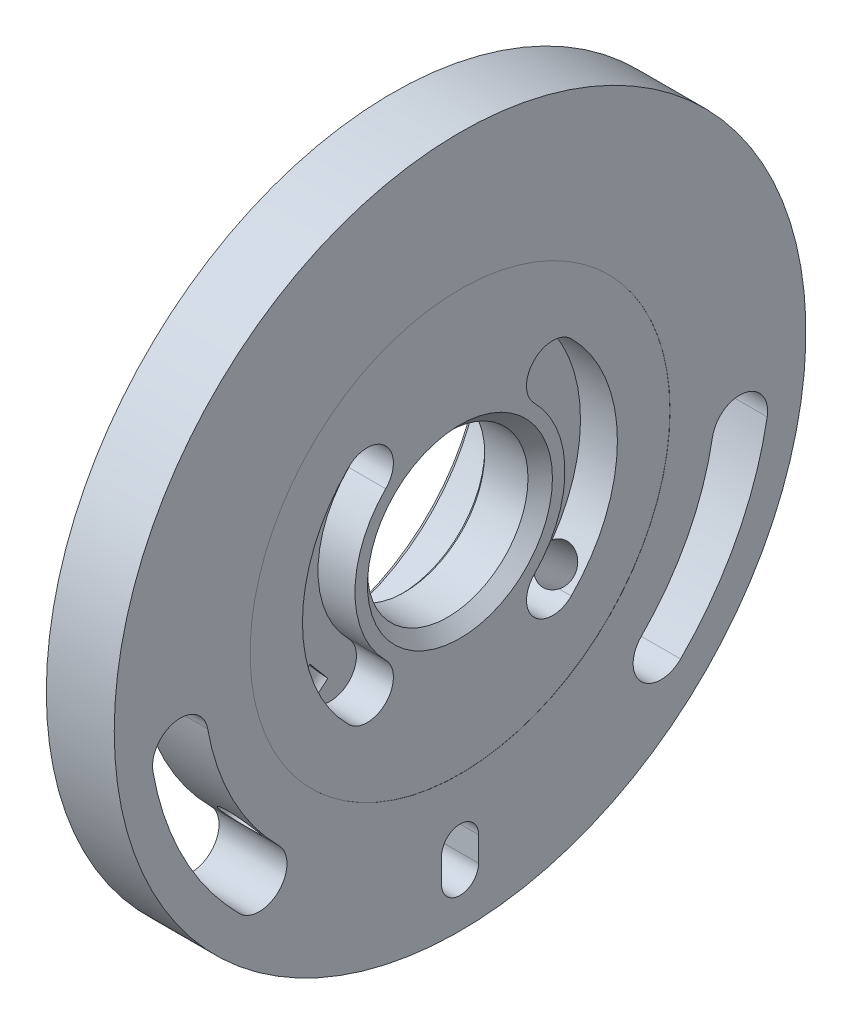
ISO-10303-21;
HEADER;
FILE_DESCRIPTION(('STEP AP214'),'2;1');
FILE_NAME('part.step','',(''),(''),'','','');
FILE_SCHEMA(('AUTOMOTIVE_DESIGN { 1 0 10303 214 1 1 1 1 }'));
ENDSEC;
DATA;
#1=APPLICATION_CONTEXT('core data for automotive mechanical design processes');
#2=APPLICATION_PROTOCOL_DEFINITION('international standard','automotive_design',2000,#1);
#3=PRODUCT_CONTEXT('',#1,'mechanical');
#4=PRODUCT('Part','Part','',(#3));
#5=PRODUCT_RELATED_PRODUCT_CATEGORY('part','',(#4));
#6=PRODUCT_DEFINITION_FORMATION('','',#4);
#7=PRODUCT_DEFINITION_CONTEXT('part definition',#1,'design');
#8=PRODUCT_DEFINITION('design','',#6,#7);
#9=PRODUCT_DEFINITION_SHAPE('','',#8);
#10=(LENGTH_UNIT() NAMED_UNIT(*) SI_UNIT(.MILLI.,.METRE.));
#11=(NAMED_UNIT(*) PLANE_ANGLE_UNIT() SI_UNIT($,.RADIAN.));
#12=(NAMED_UNIT(*) SI_UNIT($,.STERADIAN.) SOLID_ANGLE_UNIT());
#13=UNCERTAINTY_MEASURE_WITH_UNIT(LENGTH_MEASURE(1.E-05),#10,'distance_accuracy_value','');
#14=(GEOMETRIC_REPRESENTATION_CONTEXT(3) GLOBAL_UNCERTAINTY_ASSIGNED_CONTEXT((#13)) GLOBAL_UNIT_ASSIGNED_CONTEXT((#10,
#11,#12)) REPRESENTATION_CONTEXT('',''));
#15=CARTESIAN_POINT('',(0.,0.,0.));
#16=DIRECTION('',(0.,0.,1.));
#17=DIRECTION('',(1.,0.,0.));
#18=AXIS2_PLACEMENT_3D('',#15,#16,#17);
#19=CARTESIAN_POINT('',(5.50000000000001,0.,0.));
#20=DIRECTION('',(1.,0.,0.));
#21=DIRECTION('',(0.,0.,-1.));
#22=AXIS2_PLACEMENT_3D('',#19,#20,#21);
#23=CONICAL_SURFACE('',#22,7.5,0.78539816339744);
#24=CARTESIAN_POINT('',(4.49999999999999,0.,0.));
#25=DIRECTION('',(-1.,0.,0.));
#26=DIRECTION('',(0.,0.,1.));
#27=AXIS2_PLACEMENT_3D('',#24,#25,#26);
#28=CIRCLE('',#27,6.5);
#29=CARTESIAN_POINT('',(4.49999999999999,0.,6.5));
#30=VERTEX_POINT('',#29);
#31=EDGE_CURVE('E591',#30,#30,#28,.F.);
#32=ORIENTED_EDGE('',*,*,#31,.F.);
#33=EDGE_LOOP('',(#32));
#34=FACE_BOUND('',#33,.T.);
#35=CARTESIAN_POINT('',(5.49,0.,0.));
#36=DIRECTION('',(1.,0.,0.));
#37=DIRECTION('',(0.,0.,-1.));
#38=AXIS2_PLACEMENT_3D('',#35,#36,#37);
#39=CIRCLE('',#38,7.48999999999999);
#40=CARTESIAN_POINT('',(5.49,0.,-7.48999999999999));
#41=VERTEX_POINT('',#40);
#42=EDGE_CURVE('E809',#41,#41,#39,.T.);
#43=ORIENTED_EDGE('',*,*,#42,.T.);
#44=EDGE_LOOP('',(#43));
#45=FACE_BOUND('',#44,.T.);
#46=ADVANCED_FACE('F356',(#34,#45),#23,.F.);
#47=CARTESIAN_POINT('',(2.5,-7.51300955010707,7.51300955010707));
#48=DIRECTION('',(1.,0.,0.));
#49=DIRECTION('',(0.,0.,-1.));
#50=AXIS2_PLACEMENT_3D('',#47,#48,#49);
#51=CYLINDRICAL_SURFACE('',#50,2.125);
#52=CARTESIAN_POINT('',(5.49,-7.51300955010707,7.51300955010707));
#53=DIRECTION('',(1.,0.,0.));
#54=DIRECTION('',(0.,0.,-1.));
#55=AXIS2_PLACEMENT_3D('',#52,#53,#54);
#56=CIRCLE('',#55,2.125);
#57=CARTESIAN_POINT('',(5.49,-6.01040764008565,6.01040764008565));
#58=VERTEX_POINT('',#57);
#59=CARTESIAN_POINT('',(5.49,-9.01561146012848,9.01561146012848));
#60=VERTEX_POINT('',#59);
#61=EDGE_CURVE('E807',#58,#60,#56,.F.);
#62=ORIENTED_EDGE('',*,*,#61,.F.);
#63=DIRECTION('',(1.,0.,0.));
#64=VECTOR('',#63,1.);
#65=CARTESIAN_POINT('',(2.5,-6.01040764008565,6.01040764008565));
#66=LINE('',#65,#64);
#67=CARTESIAN_POINT('',(2.5,-6.01040764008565,6.01040764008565));
#68=VERTEX_POINT('',#67);
#69=EDGE_CURVE('E558',#68,#58,#66,.T.);
#70=ORIENTED_EDGE('',*,*,#69,.F.);
#71=CARTESIAN_POINT('',(2.5,-7.51300955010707,7.51300955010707));
#72=DIRECTION('',(1.,0.,0.));
#73=DIRECTION('',(0.,0.,1.));
#74=AXIS2_PLACEMENT_3D('',#71,#72,#73);
#75=CIRCLE('',#74,2.125);
#76=CARTESIAN_POINT('',(2.5,-9.02155498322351,9.009644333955));
#77=VERTEX_POINT('',#76);
#78=EDGE_CURVE('E547',#77,#68,#75,.T.);
#79=ORIENTED_EDGE('',*,*,#78,.F.);
#80=CARTESIAN_POINT('',(2.5,-9.02155498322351,9.009644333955));
#81=CARTESIAN_POINT('',(2.56293750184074,-9.06125471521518,8.96956563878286));
#82=CARTESIAN_POINT('',(2.63054764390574,-9.09567830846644,8.93173445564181));
#83=CARTESIAN_POINT('',(2.77326824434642,-9.15470785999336,8.86303112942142));
#84=CARTESIAN_POINT('',(2.84838471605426,-9.17930586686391,8.83216463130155));
#85=CARTESIAN_POINT('',(3.00420948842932,-9.21936843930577,8.77991263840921));
#86=CARTESIAN_POINT('',(3.08492094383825,-9.23482780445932,8.75853254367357));
#87=CARTESIAN_POINT('',(3.24960925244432,-9.2571086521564,8.72714443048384));
#88=CARTESIAN_POINT('',(3.333582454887,-9.2639395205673,8.71712405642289));
#89=CARTESIAN_POINT('',(3.50071850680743,-9.26919145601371,8.70945046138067));
#90=CARTESIAN_POINT('',(3.58386549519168,-9.26777302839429,8.71156119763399));
#91=CARTESIAN_POINT('',(3.74855832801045,-9.25684255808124,8.72740685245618));
#92=CARTESIAN_POINT('',(3.83010295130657,-9.24732457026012,8.74115030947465));
#93=CARTESIAN_POINT('',(3.9881693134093,-9.22004900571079,8.77877729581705));
#94=CARTESIAN_POINT('',(4.06474339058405,-9.20240257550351,8.80252368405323));
#95=CARTESIAN_POINT('',(4.21209034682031,-9.15836836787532,8.85824970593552));
#96=CARTESIAN_POINT('',(4.28287088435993,-9.131992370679,8.89021823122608));
#97=CARTESIAN_POINT('',(4.37718589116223,-9.08830454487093,8.93934470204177));
#98=CARTESIAN_POINT('',(4.4038760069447,-9.07487541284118,8.95406165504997));
#99=CARTESIAN_POINT('',(4.45587017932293,-9.04644030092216,8.98428278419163));
#100=CARTESIAN_POINT('',(4.4811763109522,-9.03143678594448,8.99978571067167));
#101=CARTESIAN_POINT('',(4.50576820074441,-9.01561146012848,9.01561146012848));
#102=B_SPLINE_CURVE_WITH_KNOTS('',3,(#80,#81,#82,#83,#84,#85,#86,#87,#88,#89,#90,#91,#92,#93,
#94,#95,#96,#97,#98,#99,#100,#101),.UNSPECIFIED.,.F.,.F.,(4,2,2,2,2,2,2,2,2,2,4),(0.,
0.253166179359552,0.506536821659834,0.760051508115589,1.01329018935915,1.26161833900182,
1.51012892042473,1.75533792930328,2.00021737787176,2.10007465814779,2.19977786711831),.UNSPECIFIED.);
#103=CARTESIAN_POINT('',(4.50576820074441,-9.01561146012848,9.01561146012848));
#104=VERTEX_POINT('',#103);
#105=EDGE_CURVE('E661',#77,#104,#102,.T.);
#106=ORIENTED_EDGE('',*,*,#105,.T.);
#107=DIRECTION('',(1.,0.,0.));
#108=VECTOR('',#107,1.);
#109=CARTESIAN_POINT('',(2.5,-9.01561146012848,9.01561146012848));
#110=LINE('',#109,#108);
#111=EDGE_CURVE('E559',#104,#60,#110,.T.);
#112=ORIENTED_EDGE('',*,*,#111,.T.);
#113=EDGE_LOOP('',(#62,#70,#79,#106,#112));
#114=FACE_BOUND('',#113,.T.);
#115=ADVANCED_FACE('F674',(#114),#51,.F.);
#116=CARTESIAN_POINT('',(2.5,0.,0.));
#117=DIRECTION('',(1.,0.,0.));
#118=DIRECTION('',(0.,0.,-1.));
#119=AXIS2_PLACEMENT_3D('',#116,#117,#118);
#120=CYLINDRICAL_SURFACE('',#119,12.75);
#121=CARTESIAN_POINT('',(5.49,0.,0.));
#122=DIRECTION('',(1.,0.,0.));
#123=DIRECTION('',(0.,0.,-1.));
#124=AXIS2_PLACEMENT_3D('',#121,#122,#123);
#125=CIRCLE('',#124,12.75);
#126=CARTESIAN_POINT('',(5.49,9.01561146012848,9.01561146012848));
#127=VERTEX_POINT('',#126);
#128=EDGE_CURVE('E805',#60,#127,#125,.F.);
#129=ORIENTED_EDGE('',*,*,#128,.F.);
#130=ORIENTED_EDGE('',*,*,#111,.F.);
#131=CARTESIAN_POINT('',(4.50576820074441,-9.01561146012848,9.01561146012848));
#132=CARTESIAN_POINT('',(4.53701409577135,-8.99550177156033,9.03572099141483));
#133=CARTESIAN_POINT('',(4.56704916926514,-8.97440539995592,9.05668276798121));
#134=CARTESIAN_POINT('',(4.62451949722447,-8.93033685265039,9.1001397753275));
#135=CARTESIAN_POINT('',(4.65195482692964,-8.9073647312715,9.12263496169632));
#136=CARTESIAN_POINT('',(4.73002686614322,-8.83584309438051,9.19210390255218));
#137=CARTESIAN_POINT('',(4.77651417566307,-8.78463396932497,9.2411157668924));
#138=CARTESIAN_POINT('',(4.85697341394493,-8.6763732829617,9.34283499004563));
#139=CARTESIAN_POINT('',(4.89093810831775,-8.61931836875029,9.39554446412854));
#140=CARTESIAN_POINT('',(4.94535568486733,-8.50079120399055,9.50291706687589));
#141=CARTESIAN_POINT('',(4.96581264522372,-8.43932029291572,9.55757960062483));
#142=CARTESIAN_POINT('',(4.99255767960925,-8.31384764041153,9.66691946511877));
#143=CARTESIAN_POINT('',(4.998904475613,-8.24985752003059,9.72159578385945));
#144=CARTESIAN_POINT('',(4.99741631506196,-8.12088444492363,9.82958851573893));
#145=CARTESIAN_POINT('',(4.98957927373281,-8.05590134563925,9.88290472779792));
#146=CARTESIAN_POINT('',(4.96001042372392,-7.92711418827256,9.98649925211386));
#147=CARTESIAN_POINT('',(4.93833297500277,-7.8633065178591,10.0367886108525));
#148=CARTESIAN_POINT('',(4.88176854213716,-7.73854034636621,10.1332975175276));
#149=CARTESIAN_POINT('',(4.84688212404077,-7.67758172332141,10.1795172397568));
#150=CARTESIAN_POINT('',(4.76474007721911,-7.5601828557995,10.2670113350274));
#151=CARTESIAN_POINT('',(4.71743825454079,-7.50376053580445,10.3082663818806));
#152=CARTESIAN_POINT('',(4.61185758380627,-7.39750287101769,10.3847843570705));
#153=CARTESIAN_POINT('',(4.55357805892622,-7.34766793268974,10.4200469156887));
#154=CARTESIAN_POINT('',(4.42730761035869,-7.25598252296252,10.4841008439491));
#155=CARTESIAN_POINT('',(4.35926425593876,-7.2141782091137,10.512854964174));
#156=CARTESIAN_POINT('',(4.21561916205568,-7.14035239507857,10.563137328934));
#157=CARTESIAN_POINT('',(4.1400175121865,-7.10833077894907,10.5846656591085));
#158=CARTESIAN_POINT('',(3.98348271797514,-7.05525200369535,10.6201197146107));
#159=CARTESIAN_POINT('',(3.9025561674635,-7.03418156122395,10.6340546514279));
#160=CARTESIAN_POINT('',(3.7376022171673,-7.00372756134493,10.6541370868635));
#161=CARTESIAN_POINT('',(3.65357510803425,-6.99434291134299,10.6602853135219));
#162=CARTESIAN_POINT('',(3.4853728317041,-6.98763157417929,10.6646857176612));
#163=CARTESIAN_POINT('',(3.40120199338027,-6.99022869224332,10.6629877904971));
#164=CARTESIAN_POINT('',(3.23455240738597,-7.00721464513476,10.6518328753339));
#165=CARTESIAN_POINT('',(3.15207418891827,-7.02160711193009,10.6423734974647));
#166=CARTESIAN_POINT('',(2.99126035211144,-7.06162745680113,10.615860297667));
#167=CARTESIAN_POINT('',(2.9129212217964,-7.08724563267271,10.5988130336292));
#168=CARTESIAN_POINT('',(2.76255091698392,-7.14878578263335,10.5574014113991));
#169=CARTESIAN_POINT('',(2.69051060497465,-7.1846924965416,10.5330478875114));
#170=CARTESIAN_POINT('',(2.60134966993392,-7.23774097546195,10.4965633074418));
#171=CARTESIAN_POINT('',(2.58045283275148,-7.25086015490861,10.4875067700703));
#172=CARTESIAN_POINT('',(2.53955577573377,-7.27791971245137,10.4687466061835));
#173=CARTESIAN_POINT('',(2.5195541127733,-7.29185867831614,10.4590440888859));
#174=CARTESIAN_POINT('',(2.49999999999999,-7.30619998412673,10.4490163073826));
#175=B_SPLINE_CURVE_WITH_KNOTS('',3,(#131,#132,#133,#134,#135,#136,#137,#138,#139,#140,#141,
#142,#143,#144,#145,#146,#147,#148,#149,#150,#151,#152,#153,#154,#155,#156,#157,#158,#159,#160,
#161,#162,#163,#164,#165,#166,#167,#168,#169,#170,#171,#172,#173,#174),.UNSPECIFIED.,.F.,.F.,(4,
2,2,2,2,2,2,2,2,2,2,2,2,2,2,2,2,2,2,2,2,4),(0.,0.126673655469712,0.25334364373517,
0.506344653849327,0.759491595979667,1.01256207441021,1.26457736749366,1.51662970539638,
1.76769811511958,2.0187557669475,2.27076110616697,2.52278198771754,2.77621069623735,
3.02963640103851,3.28275398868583,3.53584790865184,3.78733457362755,4.03889870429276,
4.29024583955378,4.54122208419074,4.62004685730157,4.6987396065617),.UNSPECIFIED.);
#176=CARTESIAN_POINT('',(2.5,-7.30619998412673,10.4490163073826));
#177=VERTEX_POINT('',#176);
#178=EDGE_CURVE('E654',#104,#177,#175,.T.);
#179=ORIENTED_EDGE('',*,*,#178,.T.);
#180=CARTESIAN_POINT('',(2.5,0.,0.));
#181=DIRECTION('',(1.,0.,0.));
#182=DIRECTION('',(0.,0.,-1.));
#183=AXIS2_PLACEMENT_3D('',#180,#181,#182);
#184=CIRCLE('',#183,12.75);
#185=CARTESIAN_POINT('',(2.5,9.01561146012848,9.01561146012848));
#186=VERTEX_POINT('',#185);
#187=EDGE_CURVE('E555',#186,#177,#184,.T.);
#188=ORIENTED_EDGE('',*,*,#187,.F.);
#189=DIRECTION('',(1.,0.,0.));
#190=VECTOR('',#189,1.);
#191=CARTESIAN_POINT('',(2.5,9.01561146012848,9.01561146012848));
#192=LINE('',#191,#190);
#193=EDGE_CURVE('E563',#186,#127,#192,.T.);
#194=ORIENTED_EDGE('',*,*,#193,.T.);
#195=EDGE_LOOP('',(#129,#130,#179,#188,#194));
#196=FACE_BOUND('',#195,.T.);
#197=ADVANCED_FACE('F668',(#196),#120,.F.);
#198=CARTESIAN_POINT('',(2.5,7.51300955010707,7.51300955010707));
#199=DIRECTION('',(1.,0.,0.));
#200=DIRECTION('',(0.,0.,-1.));
#201=AXIS2_PLACEMENT_3D('',#198,#199,#200);
#202=CYLINDRICAL_SURFACE('',#201,2.125);
#203=CARTESIAN_POINT('',(5.49,7.51300955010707,7.51300955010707));
#204=DIRECTION('',(1.,0.,0.));
#205=DIRECTION('',(0.,0.,-1.));
#206=AXIS2_PLACEMENT_3D('',#203,#204,#205);
#207=CIRCLE('',#206,2.125);
#208=CARTESIAN_POINT('',(5.49,6.01040764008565,6.01040764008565));
#209=VERTEX_POINT('',#208);
#210=EDGE_CURVE('E371',#127,#209,#207,.F.);
#211=ORIENTED_EDGE('',*,*,#210,.F.);
#212=ORIENTED_EDGE('',*,*,#193,.F.);
#213=CARTESIAN_POINT('',(2.5,7.51300955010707,7.51300955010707));
#214=DIRECTION('',(1.,0.,0.));
#215=DIRECTION('',(0.,0.,-1.));
#216=AXIS2_PLACEMENT_3D('',#213,#214,#215);
#217=CIRCLE('',#216,2.125);
#218=CARTESIAN_POINT('',(2.5,6.01040764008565,6.01040764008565));
#219=VERTEX_POINT('',#218);
#220=EDGE_CURVE('E552',#219,#186,#217,.T.);
#221=ORIENTED_EDGE('',*,*,#220,.F.);
#222=DIRECTION('',(1.,0.,0.));
#223=VECTOR('',#222,1.);
#224=CARTESIAN_POINT('',(2.5,6.01040764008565,6.01040764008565));
#225=LINE('',#224,#223);
#226=EDGE_CURVE('E566',#219,#209,#225,.T.);
#227=ORIENTED_EDGE('',*,*,#226,.T.);
#228=EDGE_LOOP('',(#211,#212,#221,#227));
#229=FACE_BOUND('',#228,.T.);
#230=ADVANCED_FACE('F673',(#229),#202,.F.);
#231=CARTESIAN_POINT('',(2.5,0.,0.));
#232=DIRECTION('',(1.,0.,0.));
#233=DIRECTION('',(0.,0.,-1.));
#234=AXIS2_PLACEMENT_3D('',#231,#232,#233);
#235=CYLINDRICAL_SURFACE('',#234,8.5);
#236=CARTESIAN_POINT('',(5.49,0.,0.));
#237=DIRECTION('',(1.,0.,0.));
#238=DIRECTION('',(0.,0.,-1.));
#239=AXIS2_PLACEMENT_3D('',#236,#237,#238);
#240=CIRCLE('',#239,8.5);
#241=EDGE_CURVE('E529',#209,#58,#240,.T.);
#242=ORIENTED_EDGE('',*,*,#241,.F.);
#243=ORIENTED_EDGE('',*,*,#226,.F.);
#244=CARTESIAN_POINT('',(2.5,0.,0.));
#245=DIRECTION('',(-1.,0.,0.));
#246=DIRECTION('',(0.,0.,-1.));
#247=AXIS2_PLACEMENT_3D('',#244,#245,#246);
#248=CIRCLE('',#247,8.5);
#249=EDGE_CURVE('E549',#68,#219,#248,.T.);
#250=ORIENTED_EDGE('',*,*,#249,.F.);
#251=ORIENTED_EDGE('',*,*,#69,.T.);
#252=EDGE_LOOP('',(#242,#243,#250,#251));
#253=FACE_BOUND('',#252,.T.);
#254=ADVANCED_FACE('F680',(#253),#235,.T.);
#255=CARTESIAN_POINT('',(2.5,0.,0.));
#256=DIRECTION('',(1.,0.,0.));
#257=DIRECTION('',(0.,0.,-1.));
#258=AXIS2_PLACEMENT_3D('',#255,#256,#257);
#259=CYLINDRICAL_SURFACE('',#258,8.5);
#260=CARTESIAN_POINT('',(5.49,0.,0.));
#261=DIRECTION('',(1.,0.,0.));
#262=DIRECTION('',(0.,0.,-1.));
#263=AXIS2_PLACEMENT_3D('',#260,#261,#262);
#264=CIRCLE('',#263,8.5);
#265=CARTESIAN_POINT('',(5.49,-6.01040764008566,-6.01040764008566));
#266=VERTEX_POINT('',#265);
#267=CARTESIAN_POINT('',(5.49,6.01040764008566,-6.01040764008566));
#268=VERTEX_POINT('',#267);
#269=EDGE_CURVE('E516',#266,#268,#264,.T.);
#270=ORIENTED_EDGE('',*,*,#269,.F.);
#271=DIRECTION('',(1.,0.,0.));
#272=VECTOR('',#271,1.);
#273=CARTESIAN_POINT('',(2.5,-6.01040764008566,-6.01040764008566));
#274=LINE('',#273,#272);
#275=CARTESIAN_POINT('',(2.5,-6.01040764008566,-6.01040764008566));
#276=VERTEX_POINT('',#275);
#277=EDGE_CURVE('E526',#276,#266,#274,.T.);
#278=ORIENTED_EDGE('',*,*,#277,.F.);
#279=CARTESIAN_POINT('',(2.5,0.,0.));
#280=DIRECTION('',(-1.,0.,0.));
#281=DIRECTION('',(0.,0.,1.));
#282=AXIS2_PLACEMENT_3D('',#279,#280,#281);
#283=CIRCLE('',#282,8.5);
#284=CARTESIAN_POINT('',(2.5,6.01040764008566,-6.01040764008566));
#285=VERTEX_POINT('',#284);
#286=EDGE_CURVE('E779',#285,#276,#283,.T.);
#287=ORIENTED_EDGE('',*,*,#286,.F.);
#288=DIRECTION('',(1.,0.,0.));
#289=VECTOR('',#288,1.);
#290=CARTESIAN_POINT('',(2.5,6.01040764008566,-6.01040764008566));
#291=LINE('',#290,#289);
#292=EDGE_CURVE('E528',#285,#268,#291,.T.);
#293=ORIENTED_EDGE('',*,*,#292,.T.);
#294=EDGE_LOOP('',(#270,#278,#287,#293));
#295=FACE_BOUND('',#294,.T.);
#296=ADVANCED_FACE('F524',(#295),#259,.T.);
#297=CARTESIAN_POINT('',(2.5,7.51300955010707,-7.51300955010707));
#298=DIRECTION('',(1.,0.,0.));
#299=DIRECTION('',(0.,0.,-1.));
#300=AXIS2_PLACEMENT_3D('',#297,#298,#299);
#301=CYLINDRICAL_SURFACE('',#300,2.125);
#302=CARTESIAN_POINT('',(5.49,7.51300955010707,-7.51300955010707));
#303=DIRECTION('',(1.,0.,0.));
#304=DIRECTION('',(0.,0.,-1.));
#305=AXIS2_PLACEMENT_3D('',#302,#303,#304);
#306=CIRCLE('',#305,2.125);
#307=CARTESIAN_POINT('',(5.49,9.01561146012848,-9.01561146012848));
#308=VERTEX_POINT('',#307);
#309=EDGE_CURVE('E530',#268,#308,#306,.F.);
#310=ORIENTED_EDGE('',*,*,#309,.F.);
#311=ORIENTED_EDGE('',*,*,#292,.F.);
#312=CARTESIAN_POINT('',(2.5,7.51300955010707,-7.51300955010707));
#313=DIRECTION('',(1.,0.,0.));
#314=DIRECTION('',(0.,0.,1.));
#315=AXIS2_PLACEMENT_3D('',#312,#313,#314);
#316=CIRCLE('',#315,2.125);
#317=CARTESIAN_POINT('',(2.5,9.01561146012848,-9.01561146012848));
#318=VERTEX_POINT('',#317);
#319=EDGE_CURVE('E538',#318,#285,#316,.T.);
#320=ORIENTED_EDGE('',*,*,#319,.F.);
#321=DIRECTION('',(1.,0.,0.));
#322=VECTOR('',#321,1.);
#323=CARTESIAN_POINT('',(2.5,9.01561146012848,-9.01561146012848));
#324=LINE('',#323,#322);
#325=EDGE_CURVE('E540',#318,#308,#324,.T.);
#326=ORIENTED_EDGE('',*,*,#325,.T.);
#327=EDGE_LOOP('',(#310,#311,#320,#326));
#328=FACE_BOUND('',#327,.T.);
#329=ADVANCED_FACE('F792',(#328),#301,.F.);
#330=CARTESIAN_POINT('',(2.5,0.,0.));
#331=DIRECTION('',(1.,0.,0.));
#332=DIRECTION('',(0.,0.,-1.));
#333=AXIS2_PLACEMENT_3D('',#330,#331,#332);
#334=CYLINDRICAL_SURFACE('',#333,12.75);
#335=CARTESIAN_POINT('',(5.49,0.,0.));
#336=DIRECTION('',(1.,0.,0.));
#337=DIRECTION('',(0.,0.,-1.));
#338=AXIS2_PLACEMENT_3D('',#335,#336,#337);
#339=CIRCLE('',#338,12.75);
#340=CARTESIAN_POINT('',(5.49,-9.01561146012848,-9.01561146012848));
#341=VERTEX_POINT('',#340);
#342=EDGE_CURVE('E378',#308,#341,#339,.F.);
#343=ORIENTED_EDGE('',*,*,#342,.F.);
#344=ORIENTED_EDGE('',*,*,#325,.F.);
#345=CARTESIAN_POINT('',(2.5,0.,0.));
#346=DIRECTION('',(1.,0.,0.));
#347=DIRECTION('',(0.,0.,1.));
#348=AXIS2_PLACEMENT_3D('',#345,#346,#347);
#349=CIRCLE('',#348,12.75);
#350=CARTESIAN_POINT('',(2.5,-7.30619998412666,-10.4490163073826));
#351=VERTEX_POINT('',#350);
#352=EDGE_CURVE('E543',#351,#318,#349,.T.);
#353=ORIENTED_EDGE('',*,*,#352,.F.);
#354=CARTESIAN_POINT('',(2.5,-7.30619998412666,-10.4490163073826));
#355=CARTESIAN_POINT('',(2.53143186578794,-7.28314516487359,-10.4651366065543));
#356=CARTESIAN_POINT('',(2.56403003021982,-7.26112966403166,-10.4804169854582));
#357=CARTESIAN_POINT('',(2.63135797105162,-7.21934058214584,-10.5092466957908));
#358=CARTESIAN_POINT('',(2.66608770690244,-7.19956695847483,-10.5227960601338));
#359=CARTESIAN_POINT('',(2.77307880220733,-7.14390243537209,-10.5607376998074));
#360=CARTESIAN_POINT('',(2.84822754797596,-7.11160510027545,-10.5824670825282));
#361=CARTESIAN_POINT('',(3.00401186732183,-7.05784008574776,-10.6184013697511));
#362=CARTESIAN_POINT('',(3.08465081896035,-7.03637914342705,-10.6326015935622));
#363=CARTESIAN_POINT('',(3.24910194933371,-7.00508540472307,-10.65324519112));
#364=CARTESIAN_POINT('',(3.33291312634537,-6.99524896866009,-10.6596909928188));
#365=CARTESIAN_POINT('',(3.5009327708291,-6.98758660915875,-10.664715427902));
#366=CARTESIAN_POINT('',(3.58513772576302,-6.98970655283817,-10.6633295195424));
#367=CARTESIAN_POINT('',(3.75193608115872,-7.00575082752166,-10.6527951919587));
#368=CARTESIAN_POINT('',(3.83452920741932,-7.01967714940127,-10.6436454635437));
#369=CARTESIAN_POINT('',(3.9956104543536,-7.05878814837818,-10.6177471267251));
#370=CARTESIAN_POINT('',(4.07410520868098,-7.08395395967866,-10.6010112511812));
#371=CARTESIAN_POINT('',(4.22494473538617,-7.14463086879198,-10.5602121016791));
#372=CARTESIAN_POINT('',(4.29728971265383,-7.18014162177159,-10.5361490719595));
#373=CARTESIAN_POINT('',(4.43421550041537,-7.26049540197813,-10.4809392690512));
#374=CARTESIAN_POINT('',(4.49875120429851,-7.30538890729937,-10.4497540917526));
#375=CARTESIAN_POINT('',(4.61779921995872,-7.40286469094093,-10.3809270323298));
#376=CARTESIAN_POINT('',(4.67231101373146,-7.4554473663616,-10.3432848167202));
#377=CARTESIAN_POINT('',(4.76997998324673,-7.56679773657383,-10.2621065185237));
#378=CARTESIAN_POINT('',(4.81309030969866,-7.62558960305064,-10.2185471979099));
#379=CARTESIAN_POINT('',(4.88642438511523,-7.74728532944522,-10.1265926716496));
#380=CARTESIAN_POINT('',(4.9166485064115,-7.81018907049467,-10.078197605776));
#381=CARTESIAN_POINT('',(4.96323955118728,-7.93790377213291,-9.97791298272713));
#382=CARTESIAN_POINT('',(4.97965630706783,-8.00270699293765,-9.92603672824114));
#383=CARTESIAN_POINT('',(4.99832802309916,-8.13247590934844,-9.81999762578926));
#384=CARTESIAN_POINT('',(5.00058422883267,-8.19744159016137,-9.76583497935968));
#385=CARTESIAN_POINT('',(4.99089991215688,-8.32528611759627,-9.65707595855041));
#386=CARTESIAN_POINT('',(4.97904096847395,-8.38817481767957,-9.60248387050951));
#387=CARTESIAN_POINT('',(4.94160218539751,-8.51057038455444,-9.49417580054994));
#388=CARTESIAN_POINT('',(4.91601789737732,-8.57007614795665,-9.44046010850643));
#389=CARTESIAN_POINT('',(4.85182769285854,-8.68425647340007,-9.33553536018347));
#390=CARTESIAN_POINT('',(4.81319952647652,-8.7389225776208,-9.28433075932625));
#391=CARTESIAN_POINT('',(4.72404625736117,-8.84196872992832,-9.18624748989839));
#392=CARTESIAN_POINT('',(4.67353876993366,-8.89035792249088,-9.13936255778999));
#393=CARTESIAN_POINT('',(4.60018577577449,-8.94924020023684,-9.08151967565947));
#394=CARTESIAN_POINT('',(4.58198005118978,-8.963062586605,-9.06787567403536));
#395=CARTESIAN_POINT('',(4.54459774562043,-8.9899221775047,-9.04124738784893));
#396=CARTESIAN_POINT('',(4.52542283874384,-9.00296065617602,-9.02826203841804));
#397=CARTESIAN_POINT('',(4.50576820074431,-9.01561146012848,-9.01561146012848));
#398=B_SPLINE_CURVE_WITH_KNOTS('',3,(#354,#355,#356,#357,#358,#359,#360,#361,#362,#363,#364,
#365,#366,#367,#368,#369,#370,#371,#372,#373,#374,#375,#376,#377,#378,#379,#380,#381,#382,#383,
#384,#385,#386,#387,#388,#389,#390,#391,#392,#393,#394,#395,#396,#397),.UNSPECIFIED.,.F.,.F.,(4,
2,2,2,2,2,2,2,2,2,2,2,2,2,2,2,2,2,2,2,2,4),(0.,0.126469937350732,0.25293746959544,
0.505532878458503,0.758285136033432,1.01095823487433,1.26248826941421,1.51406072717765,
1.76521249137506,2.01635588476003,2.26888688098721,2.52143092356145,2.77499710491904,
3.02855595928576,3.28119571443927,3.53381324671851,3.78497783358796,4.03622387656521,
4.28790067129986,4.53920659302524,4.61904261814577,4.69874516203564),.UNSPECIFIED.);
#399=CARTESIAN_POINT('',(4.50576820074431,-9.01561146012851,-9.01561146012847));
#400=VERTEX_POINT('',#399);
#401=EDGE_CURVE('E841',#351,#400,#398,.T.);
#402=ORIENTED_EDGE('',*,*,#401,.T.);
#403=DIRECTION('',(1.,0.,0.));
#404=VECTOR('',#403,1.);
#405=CARTESIAN_POINT('',(2.5,-9.01561146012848,-9.01561146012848));
#406=LINE('',#405,#404);
#407=EDGE_CURVE('E537',#400,#341,#406,.T.);
#408=ORIENTED_EDGE('',*,*,#407,.T.);
#409=EDGE_LOOP('',(#343,#344,#353,#402,#408));
#410=FACE_BOUND('',#409,.T.);
#411=ADVANCED_FACE('F738',(#410),#334,.F.);
#412=CARTESIAN_POINT('',(2.5,-7.51300955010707,-7.51300955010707));
#413=DIRECTION('',(1.,0.,0.));
#414=DIRECTION('',(0.,0.,-1.));
#415=AXIS2_PLACEMENT_3D('',#412,#413,#414);
#416=CYLINDRICAL_SURFACE('',#415,2.125);
#417=CARTESIAN_POINT('',(5.49,-7.51300955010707,-7.51300955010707));
#418=DIRECTION('',(1.,0.,0.));
#419=DIRECTION('',(0.,0.,-1.));
#420=AXIS2_PLACEMENT_3D('',#417,#418,#419);
#421=CIRCLE('',#420,2.125);
#422=EDGE_CURVE('E11',#341,#266,#421,.F.);
#423=ORIENTED_EDGE('',*,*,#422,.F.);
#424=ORIENTED_EDGE('',*,*,#407,.F.);
#425=CARTESIAN_POINT('',(4.45169318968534,-6.1836096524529,-9.17081560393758));
#426=CARTESIAN_POINT('',(4.46650638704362,-6.23217280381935,-9.20973833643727));
#427=CARTESIAN_POINT('',(4.48376455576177,-6.2818771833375,-9.24611233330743));
#428=CARTESIAN_POINT('',(4.52159919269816,-6.38326485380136,-9.31385066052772));
#429=CARTESIAN_POINT('',(4.54216939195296,-6.43494426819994,-9.34522423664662));
#430=CARTESIAN_POINT('',(4.58523036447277,-6.54042383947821,-9.40333842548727));
#431=CARTESIAN_POINT('',(4.60773019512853,-6.59423327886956,-9.43005517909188));
#432=CARTESIAN_POINT('',(4.65337749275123,-6.70369745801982,-9.47877354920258));
#433=CARTESIAN_POINT('',(4.67652526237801,-6.75935306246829,-9.50077291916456));
#434=CARTESIAN_POINT('',(4.74287476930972,-6.92282035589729,-9.55754510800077));
#435=CARTESIAN_POINT('',(4.78560557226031,-7.03300249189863,-9.5862810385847));
#436=CARTESIAN_POINT('',(4.86355464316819,-7.25889356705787,-9.62585365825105));
#437=CARTESIAN_POINT('',(4.89879636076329,-7.37458382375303,-9.6367469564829));
#438=CARTESIAN_POINT('',(4.9473751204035,-7.57503212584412,-9.63872509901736));
#439=CARTESIAN_POINT('',(4.96410522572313,-7.65890773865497,-9.63468361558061));
#440=CARTESIAN_POINT('',(4.98840619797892,-7.82694344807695,-9.61638630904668));
#441=CARTESIAN_POINT('',(4.99598136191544,-7.9111033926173,-9.60213528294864));
#442=CARTESIAN_POINT('',(4.99962172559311,-8.07818791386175,-9.56328076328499));
#443=CARTESIAN_POINT('',(4.99557868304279,-8.16109359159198,-9.53858175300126));
#444=CARTESIAN_POINT('',(4.97384924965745,-8.32169805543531,-9.47996959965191));
#445=CARTESIAN_POINT('',(4.95617670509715,-8.39940203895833,-9.44606583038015));
#446=CARTESIAN_POINT('',(4.91003165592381,-8.53626821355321,-9.3767753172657));
#447=CARTESIAN_POINT('',(4.88341176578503,-8.5965044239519,-9.34225669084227));
#448=CARTESIAN_POINT('',(4.8200068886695,-8.7094932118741,-9.27043187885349));
#449=CARTESIAN_POINT('',(4.783221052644,-8.76224516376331,-9.23312546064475));
#450=CARTESIAN_POINT('',(4.70150609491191,-8.85827578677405,-9.15905794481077));
#451=CARTESIAN_POINT('',(4.6568101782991,-8.90176282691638,-9.12230742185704));
#452=CARTESIAN_POINT('',(4.55978251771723,-8.98087938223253,-9.05048850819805));
#453=CARTESIAN_POINT('',(4.50744842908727,-9.01650647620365,-9.01542063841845));
#454=CARTESIAN_POINT('',(4.39092068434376,-9.08326137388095,-8.94566049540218));
#455=CARTESIAN_POINT('',(4.32606977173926,-9.11362221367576,-8.91133166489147));
#456=CARTESIAN_POINT('',(4.19008147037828,-9.16582022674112,-8.84923247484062));
#457=CARTESIAN_POINT('',(4.11894138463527,-9.18765372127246,-8.82146494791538));
#458=CARTESIAN_POINT('',(3.96678073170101,-9.22462311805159,-8.77277610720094));
#459=CARTESIAN_POINT('',(3.88541718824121,-9.23917746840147,-8.7524764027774));
#460=CARTESIAN_POINT('',(3.71961009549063,-9.25965818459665,-8.72344987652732));
#461=CARTESIAN_POINT('',(3.63516758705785,-9.26558743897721,-8.7147191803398));
#462=CARTESIAN_POINT('',(3.46779808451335,-9.26900503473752,-8.70971875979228));
#463=CARTESIAN_POINT('',(3.38488400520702,-9.26669460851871,-8.71315195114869));
#464=CARTESIAN_POINT('',(3.22096845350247,-9.2539944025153,-8.73149945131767));
#465=CARTESIAN_POINT('',(3.13996722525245,-9.2436035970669,-8.74641521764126));
#466=CARTESIAN_POINT('',(2.98291933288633,-9.21453428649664,-8.78620733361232));
#467=CARTESIAN_POINT('',(2.90683097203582,-9.19594033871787,-8.81098181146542));
#468=CARTESIAN_POINT('',(2.76056970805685,-9.14991291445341,-8.86856346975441));
#469=CARTESIAN_POINT('',(2.69039917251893,-9.1224759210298,-8.90137384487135));
#470=CARTESIAN_POINT('',(2.55527651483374,-9.05690937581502,-8.97399331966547));
#471=CARTESIAN_POINT('',(2.49060854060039,-9.0184259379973,-9.01401424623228));
#472=CARTESIAN_POINT('',(2.37140051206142,-8.93063866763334,-9.09717988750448));
#473=CARTESIAN_POINT('',(2.31685539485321,-8.88134027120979,-9.14032302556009));
#474=CARTESIAN_POINT('',(2.2219865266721,-8.77446396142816,-9.22436968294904));
#475=CARTESIAN_POINT('',(2.18111620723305,-8.71738217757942,-9.26528342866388));
#476=CARTESIAN_POINT('',(2.11152651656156,-8.5942699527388,-9.34380442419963));
#477=CARTESIAN_POINT('',(2.08279627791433,-8.52824758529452,-9.38141460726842));
#478=CARTESIAN_POINT('',(2.04021998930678,-8.3962818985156,-9.44700103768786));
#479=CARTESIAN_POINT('',(2.02515197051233,-8.33102141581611,-9.47556923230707));
#480=CARTESIAN_POINT('',(2.00473479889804,-8.1966334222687,-9.52632588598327));
#481=CARTESIAN_POINT('',(1.99938670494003,-8.12750549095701,-9.54851364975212));
#482=CARTESIAN_POINT('',(1.99738914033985,-7.98684190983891,-9.58579484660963));
#483=CARTESIAN_POINT('',(2.00079238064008,-7.91529424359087,-9.60084464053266));
#484=CARTESIAN_POINT('',(2.01499025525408,-7.77178661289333,-9.62344760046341));
#485=CARTESIAN_POINT('',(2.02578806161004,-7.69982648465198,-9.63099754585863));
#486=CARTESIAN_POINT('',(2.05997287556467,-7.52175868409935,-9.64066242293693));
#487=CARTESIAN_POINT('',(2.08693015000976,-7.4160918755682,-9.63833846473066));
#488=CARTESIAN_POINT('',(2.14919784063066,-7.2085836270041,-9.61868803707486));
#489=CARTESIAN_POINT('',(2.18453209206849,-7.10675408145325,-9.60131837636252));
#490=CARTESIAN_POINT('',(2.2601871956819,-6.90541616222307,-9.5520023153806));
#491=CARTESIAN_POINT('',(2.30061650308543,-6.80604361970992,-9.51967688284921));
#492=CARTESIAN_POINT('',(2.38071444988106,-6.61307637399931,-9.44085302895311));
#493=CARTESIAN_POINT('',(2.420385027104,-6.51946503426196,-9.39439796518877));
#494=CARTESIAN_POINT('',(2.47332236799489,-6.38661181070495,-9.31557791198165));
#495=CARTESIAN_POINT('',(2.48937024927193,-6.34504822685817,-9.288949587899));
#496=CARTESIAN_POINT('',(2.51907641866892,-6.2632720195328,-9.23238527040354));
#497=CARTESIAN_POINT('',(2.53273180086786,-6.22306108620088,-9.20244532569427));
#498=CARTESIAN_POINT('',(2.5447450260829,-6.1836096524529,-9.17081560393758));
#499=B_SPLINE_CURVE_WITH_KNOTS('',3,(#425,#426,#427,#428,#429,#430,#431,#432,#433,#434,#435,
#436,#437,#438,#439,#440,#441,#442,#443,#444,#445,#446,#447,#448,#449,#450,#451,#452,#453,#454,
#455,#456,#457,#458,#459,#460,#461,#462,#463,#464,#465,#466,#467,#468,#469,#470,#471,#472,#473,
#474,#475,#476,#477,#478,#479,#480,#481,#482,#483,#484,#485,#486,#487,#488,#489,#490,#491,#492,
#493,#494,#495,#496,#497,#498),.UNSPECIFIED.,.F.,.F.,(4,2,2,2,2,2,2,2,2,2,2,2,2,2,2,2,2,2,2,2,2,
2,2,2,2,2,2,2,2,2,2,2,2,2,2,2,4),(0.,0.191649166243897,0.382939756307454,0.57518331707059,
0.767518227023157,1.13088209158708,1.49309086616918,1.74903822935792,2.00486541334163,
2.2630837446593,2.52104009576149,2.74297697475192,2.96493239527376,3.18119183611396,
3.3975178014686,3.63473850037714,3.87206142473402,4.12613633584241,4.38012613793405,
4.62795584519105,4.87581701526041,5.1211808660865,5.36664242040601,5.62106785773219,
5.875365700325,6.11774913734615,6.35991513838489,6.57730791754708,6.79472437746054,
7.01345344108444,7.23227639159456,7.55769050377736,7.88404188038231,8.21915983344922,
8.5532596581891,8.70882022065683,8.86456843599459),.UNSPECIFIED.);
#500=CARTESIAN_POINT('',(2.5,-9.02155498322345,-9.00964433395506));
#501=VERTEX_POINT('',#500);
#502=EDGE_CURVE('E836',#400,#501,#499,.T.);
#503=ORIENTED_EDGE('',*,*,#502,.T.);
#504=CARTESIAN_POINT('',(2.5,-7.51300955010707,-7.51300955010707));
#505=DIRECTION('',(1.,0.,0.));
#506=DIRECTION('',(0.,0.,-1.));
#507=AXIS2_PLACEMENT_3D('',#504,#505,#506);
#508=CIRCLE('',#507,2.125);
#509=EDGE_CURVE('E535',#276,#501,#508,.T.);
#510=ORIENTED_EDGE('',*,*,#509,.F.);
#511=ORIENTED_EDGE('',*,*,#277,.T.);
#512=EDGE_LOOP('',(#423,#424,#503,#510,#511));
#513=FACE_BOUND('',#512,.T.);
#514=ADVANCED_FACE('F532',(#513),#416,.F.);
#515=CARTESIAN_POINT('',(5.5,28.,0.));
#516=DIRECTION('',(-1.,0.,0.));
#517=DIRECTION('',(0.,0.,1.));
#518=AXIS2_PLACEMENT_3D('',#515,#516,#517);
#519=PLANE('',#518);
#520=CARTESIAN_POINT('',(5.5,0.,0.));
#521=DIRECTION('',(1.,0.,0.));
#522=DIRECTION('',(0.,0.,-1.));
#523=AXIS2_PLACEMENT_3D('',#520,#521,#522);
#524=CIRCLE('',#523,17.);
#525=CARTESIAN_POINT('',(5.5,0.,-17.));
#526=VERTEX_POINT('',#525);
#527=EDGE_CURVE('E743',#526,#526,#524,.T.);
#528=ORIENTED_EDGE('',*,*,#527,.F.);
#529=EDGE_LOOP('',(#528));
#530=FACE_BOUND('',#529,.T.);
#531=DIRECTION('',(0.,-1.,0.));
#532=VECTOR('',#531,1.);
#533=CARTESIAN_POINT('',(5.5,-22.,1.5));
#534=LINE('',#533,#532);
#535=CARTESIAN_POINT('',(5.5,-22.,1.5));
#536=VERTEX_POINT('',#535);
#537=CARTESIAN_POINT('',(5.5,-24.,1.5));
#538=VERTEX_POINT('',#537);
#539=EDGE_CURVE('E749',#536,#538,#534,.T.);
#540=ORIENTED_EDGE('',*,*,#539,.F.);
#541=CARTESIAN_POINT('',(5.5,-22.,0.));
#542=DIRECTION('',(1.,0.,0.));
#543=DIRECTION('',(0.,0.,-1.));
#544=AXIS2_PLACEMENT_3D('',#541,#542,#543);
#545=CIRCLE('',#544,1.5);
#546=CARTESIAN_POINT('',(5.5,-22.,-1.5));
#547=VERTEX_POINT('',#546);
#548=EDGE_CURVE('E812',#547,#536,#545,.T.);
#549=ORIENTED_EDGE('',*,*,#548,.F.);
#550=DIRECTION('',(0.,1.,0.));
#551=VECTOR('',#550,1.);
#552=CARTESIAN_POINT('',(5.5,-22.,-1.5));
#553=LINE('',#552,#551);
#554=CARTESIAN_POINT('',(5.5,-24.,-1.5));
#555=VERTEX_POINT('',#554);
#556=EDGE_CURVE('E818',#555,#547,#553,.T.);
#557=ORIENTED_EDGE('',*,*,#556,.F.);
#558=CARTESIAN_POINT('',(5.5,-24.,0.));
#559=DIRECTION('',(1.,0.,0.));
#560=DIRECTION('',(0.,0.,-1.));
#561=AXIS2_PLACEMENT_3D('',#558,#559,#560);
#562=CIRCLE('',#561,1.5);
#563=EDGE_CURVE('E815',#538,#555,#562,.T.);
#564=ORIENTED_EDGE('',*,*,#563,.F.);
#565=EDGE_LOOP('',(#540,#549,#557,#564));
#566=FACE_BOUND('',#565,.T.);
#567=CARTESIAN_POINT('',(5.5,-3.99390808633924,-22.6505783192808));
#568=DIRECTION('',(1.,0.,0.));
#569=DIRECTION('',(0.,0.,1.));
#570=AXIS2_PLACEMENT_3D('',#567,#568,#569);
#571=CIRCLE('',#570,2.24999999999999);
#572=CARTESIAN_POINT('',(5.5,-4.38461648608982,-24.8663957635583));
#573=VERTEX_POINT('',#572);
#574=CARTESIAN_POINT('',(5.5,-3.60319968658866,-20.4347608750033));
#575=VERTEX_POINT('',#574);
#576=EDGE_CURVE('E755',#573,#575,#571,.T.);
#577=ORIENTED_EDGE('',*,*,#576,.F.);
#578=CARTESIAN_POINT('',(5.5,0.,0.));
#579=DIRECTION('',(1.,0.,0.));
#580=DIRECTION('',(0.,0.,1.));
#581=AXIS2_PLACEMENT_3D('',#578,#579,#580);
#582=CIRCLE('',#581,25.25);
#583=CARTESIAN_POINT('',(5.5,-17.8544462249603,-17.8544462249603));
#584=VERTEX_POINT('',#583);
#585=EDGE_CURVE('E1089',#584,#573,#582,.T.);
#586=ORIENTED_EDGE('',*,*,#585,.F.);
#587=CARTESIAN_POINT('',(5.5,-16.2634559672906,-16.2634559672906));
#588=DIRECTION('',(1.,0.,0.));
#589=DIRECTION('',(0.,0.,1.));
#590=AXIS2_PLACEMENT_3D('',#587,#588,#589);
#591=CIRCLE('',#590,2.25);
#592=CARTESIAN_POINT('',(5.5,-14.6724657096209,-14.6724657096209));
#593=VERTEX_POINT('',#592);
#594=EDGE_CURVE('E1084',#593,#584,#591,.T.);
#595=ORIENTED_EDGE('',*,*,#594,.F.);
#596=CARTESIAN_POINT('',(5.5,0.,0.));
#597=DIRECTION('',(-1.,0.,0.));
#598=DIRECTION('',(0.,0.,1.));
#599=AXIS2_PLACEMENT_3D('',#596,#597,#598);
#600=CIRCLE('',#599,20.75);
#601=EDGE_CURVE('E1075',#575,#593,#600,.T.);
#602=ORIENTED_EDGE('',*,*,#601,.F.);
#603=EDGE_LOOP('',(#577,#586,#595,#602));
#604=FACE_BOUND('',#603,.T.);
#605=CARTESIAN_POINT('',(5.5,-16.2634559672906,16.2634559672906));
#606=DIRECTION('',(1.,0.,0.));
#607=DIRECTION('',(0.,0.,-1.));
#608=AXIS2_PLACEMENT_3D('',#605,#606,#607);
#609=CIRCLE('',#608,2.25);
#610=CARTESIAN_POINT('',(5.5,-17.8544462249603,17.8544462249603));
#611=VERTEX_POINT('',#610);
#612=CARTESIAN_POINT('',(5.5,-14.6724657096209,14.6724657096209));
#613=VERTEX_POINT('',#612);
#614=EDGE_CURVE('E760',#611,#613,#609,.T.);
#615=ORIENTED_EDGE('',*,*,#614,.F.);
#616=CARTESIAN_POINT('',(5.5,0.,0.));
#617=DIRECTION('',(1.,0.,0.));
#618=DIRECTION('',(0.,0.,-1.));
#619=AXIS2_PLACEMENT_3D('',#616,#617,#618);
#620=CIRCLE('',#619,25.25);
#621=CARTESIAN_POINT('',(5.5,-4.38461648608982,24.8663957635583));
#622=VERTEX_POINT('',#621);
#623=EDGE_CURVE('E762',#622,#611,#620,.T.);
#624=ORIENTED_EDGE('',*,*,#623,.F.);
#625=CARTESIAN_POINT('',(5.5,-3.99390808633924,22.6505783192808));
#626=DIRECTION('',(1.,0.,0.));
#627=DIRECTION('',(0.,0.,-1.));
#628=AXIS2_PLACEMENT_3D('',#625,#626,#627);
#629=CIRCLE('',#628,2.24999999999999);
#630=CARTESIAN_POINT('',(5.5,-3.60319968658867,20.4347608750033));
#631=VERTEX_POINT('',#630);
#632=EDGE_CURVE('E768',#631,#622,#629,.T.);
#633=ORIENTED_EDGE('',*,*,#632,.F.);
#634=CARTESIAN_POINT('',(5.5,0.,0.));
#635=DIRECTION('',(-1.,0.,0.));
#636=DIRECTION('',(0.,0.,-1.));
#637=AXIS2_PLACEMENT_3D('',#634,#635,#636);
#638=CIRCLE('',#637,20.75);
#639=EDGE_CURVE('E764',#613,#631,#638,.T.);
#640=ORIENTED_EDGE('',*,*,#639,.F.);
#641=EDGE_LOOP('',(#615,#624,#633,#640));
#642=FACE_BOUND('',#641,.T.);
#643=CARTESIAN_POINT('',(5.50000000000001,0.,0.));
#644=DIRECTION('',(-1.,0.,0.));
#645=DIRECTION('',(0.,0.,1.));
#646=AXIS2_PLACEMENT_3D('',#643,#644,#645);
#647=CIRCLE('',#646,28.);
#648=CARTESIAN_POINT('',(5.50000000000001,0.,28.));
#649=VERTEX_POINT('',#648);
#650=EDGE_CURVE('E582',#649,#649,#647,.T.);
#651=ORIENTED_EDGE('',*,*,#650,.F.);
#652=EDGE_LOOP('',(#651));
#653=FACE_BOUND('',#652,.T.);
#654=ADVANCED_FACE('F358',(#530,#566,#604,#642,#653),#519,.F.);
#655=CARTESIAN_POINT('',(-120.,0.,0.));
#656=DIRECTION('',(-1.,0.,0.));
#657=DIRECTION('',(0.,0.,1.));
#658=AXIS2_PLACEMENT_3D('',#655,#656,#657);
#659=CYLINDRICAL_SURFACE('',#658,28.);
#660=CARTESIAN_POINT('',(0.,0.,0.));
#661=DIRECTION('',(-1.,0.,0.));
#662=DIRECTION('',(0.,0.,1.));
#663=AXIS2_PLACEMENT_3D('',#660,#661,#662);
#664=CIRCLE('',#663,28.);
#665=CARTESIAN_POINT('',(0.,0.,28.));
#666=VERTEX_POINT('',#665);
#667=EDGE_CURVE('E579',#666,#666,#664,.T.);
#668=ORIENTED_EDGE('',*,*,#667,.F.);
#669=EDGE_LOOP('',(#668));
#670=FACE_BOUND('',#669,.T.);
#671=ORIENTED_EDGE('',*,*,#650,.T.);
#672=EDGE_LOOP('',(#671));
#673=FACE_BOUND('',#672,.T.);
#674=ADVANCED_FACE('F721',(#670,#673),#659,.T.);
#675=CARTESIAN_POINT('',(0.,28.,0.));
#676=DIRECTION('',(1.,0.,0.));
#677=DIRECTION('',(0.,0.,-1.));
#678=AXIS2_PLACEMENT_3D('',#675,#676,#677);
#679=PLANE('',#678);
#680=DIRECTION('',(0.,1.,0.));
#681=VECTOR('',#680,1.);
#682=CARTESIAN_POINT('',(0.,28.,-1.5));
#683=LINE('',#682,#681);
#684=CARTESIAN_POINT('',(0.,-24.,-1.5));
#685=VERTEX_POINT('',#684);
#686=CARTESIAN_POINT('',(0.,-22.,-1.5));
#687=VERTEX_POINT('',#686);
#688=EDGE_CURVE('E1058',#685,#687,#683,.T.);
#689=ORIENTED_EDGE('',*,*,#688,.T.);
#690=CARTESIAN_POINT('',(0.,-22.,0.));
#691=DIRECTION('',(1.,0.,0.));
#692=DIRECTION('',(0.,0.,-1.));
#693=AXIS2_PLACEMENT_3D('',#690,#691,#692);
#694=CIRCLE('',#693,1.5);
#695=CARTESIAN_POINT('',(0.,-22.,1.5));
#696=VERTEX_POINT('',#695);
#697=EDGE_CURVE('E364',#687,#696,#694,.T.);
#698=ORIENTED_EDGE('',*,*,#697,.T.);
#699=DIRECTION('',(0.,-1.,0.));
#700=VECTOR('',#699,1.);
#701=CARTESIAN_POINT('',(0.,28.,1.5));
#702=LINE('',#701,#700);
#703=CARTESIAN_POINT('',(0.,-24.,1.5));
#704=VERTEX_POINT('',#703);
#705=EDGE_CURVE('E1051',#696,#704,#702,.T.);
#706=ORIENTED_EDGE('',*,*,#705,.T.);
#707=CARTESIAN_POINT('',(0.,-24.,0.));
#708=DIRECTION('',(1.,0.,0.));
#709=DIRECTION('',(0.,0.,-1.));
#710=AXIS2_PLACEMENT_3D('',#707,#708,#709);
#711=CIRCLE('',#710,1.5);
#712=EDGE_CURVE('E1055',#704,#685,#711,.T.);
#713=ORIENTED_EDGE('',*,*,#712,.T.);
#714=EDGE_LOOP('',(#689,#698,#706,#713));
#715=FACE_BOUND('',#714,.T.);
#716=CARTESIAN_POINT('',(0.,-16.2634559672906,-16.2634559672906));
#717=DIRECTION('',(1.,0.,0.));
#718=DIRECTION('',(0.,0.,-1.));
#719=AXIS2_PLACEMENT_3D('',#716,#717,#718);
#720=CIRCLE('',#719,2.25);
#721=CARTESIAN_POINT('',(0.,-14.6724657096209,-14.6724657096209));
#722=VERTEX_POINT('',#721);
#723=CARTESIAN_POINT('',(0.,-17.8544462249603,-17.8544462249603));
#724=VERTEX_POINT('',#723);
#725=EDGE_CURVE('E618',#722,#724,#720,.T.);
#726=ORIENTED_EDGE('',*,*,#725,.T.);
#727=CARTESIAN_POINT('',(0.,0.,0.));
#728=DIRECTION('',(1.,0.,0.));
#729=DIRECTION('',(0.,0.,-1.));
#730=AXIS2_PLACEMENT_3D('',#727,#728,#729);
#731=CIRCLE('',#730,25.25);
#732=CARTESIAN_POINT('',(0.,-4.38461648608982,-24.8663957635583));
#733=VERTEX_POINT('',#732);
#734=EDGE_CURVE('E621',#724,#733,#731,.T.);
#735=ORIENTED_EDGE('',*,*,#734,.T.);
#736=CARTESIAN_POINT('',(0.,-3.99390808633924,-22.6505783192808));
#737=DIRECTION('',(1.,0.,0.));
#738=DIRECTION('',(0.,0.,-1.));
#739=AXIS2_PLACEMENT_3D('',#736,#737,#738);
#740=CIRCLE('',#739,2.24999999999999);
#741=CARTESIAN_POINT('',(0.,-3.60319968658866,-20.4347608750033));
#742=VERTEX_POINT('',#741);
#743=EDGE_CURVE('E612',#733,#742,#740,.T.);
#744=ORIENTED_EDGE('',*,*,#743,.T.);
#745=CARTESIAN_POINT('',(0.,0.,0.));
#746=DIRECTION('',(1.,0.,0.));
#747=DIRECTION('',(0.,0.,-1.));
#748=AXIS2_PLACEMENT_3D('',#745,#746,#747);
#749=CIRCLE('',#748,20.75);
#750=EDGE_CURVE('E615',#742,#722,#749,.F.);
#751=ORIENTED_EDGE('',*,*,#750,.T.);
#752=EDGE_LOOP('',(#726,#735,#744,#751));
#753=FACE_BOUND('',#752,.T.);
#754=CARTESIAN_POINT('',(0.,-3.99390808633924,22.6505783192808));
#755=DIRECTION('',(1.,0.,0.));
#756=DIRECTION('',(0.,0.,-1.));
#757=AXIS2_PLACEMENT_3D('',#754,#755,#756);
#758=CIRCLE('',#757,2.24999999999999);
#759=CARTESIAN_POINT('',(0.,-3.60319968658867,20.4347608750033));
#760=VERTEX_POINT('',#759);
#761=CARTESIAN_POINT('',(0.,-4.38461648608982,24.8663957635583));
#762=VERTEX_POINT('',#761);
#763=EDGE_CURVE('E606',#760,#762,#758,.T.);
#764=ORIENTED_EDGE('',*,*,#763,.T.);
#765=CARTESIAN_POINT('',(0.,0.,0.));
#766=DIRECTION('',(1.,0.,0.));
#767=DIRECTION('',(0.,0.,-1.));
#768=AXIS2_PLACEMENT_3D('',#765,#766,#767);
#769=CIRCLE('',#768,25.25);
#770=CARTESIAN_POINT('',(0.,-17.8544462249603,17.8544462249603));
#771=VERTEX_POINT('',#770);
#772=EDGE_CURVE('E609',#762,#771,#769,.T.);
#773=ORIENTED_EDGE('',*,*,#772,.T.);
#774=CARTESIAN_POINT('',(0.,-16.2634559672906,16.2634559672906));
#775=DIRECTION('',(1.,0.,0.));
#776=DIRECTION('',(0.,0.,-1.));
#777=AXIS2_PLACEMENT_3D('',#774,#775,#776);
#778=CIRCLE('',#777,2.25);
#779=CARTESIAN_POINT('',(0.,-14.6724657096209,14.6724657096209));
#780=VERTEX_POINT('',#779);
#781=EDGE_CURVE('E600',#771,#780,#778,.T.);
#782=ORIENTED_EDGE('',*,*,#781,.T.);
#783=CARTESIAN_POINT('',(0.,0.,0.));
#784=DIRECTION('',(1.,0.,0.));
#785=DIRECTION('',(0.,0.,-1.));
#786=AXIS2_PLACEMENT_3D('',#783,#784,#785);
#787=CIRCLE('',#786,20.75);
#788=EDGE_CURVE('E603',#780,#760,#787,.F.);
#789=ORIENTED_EDGE('',*,*,#788,.T.);
#790=EDGE_LOOP('',(#764,#773,#782,#789));
#791=FACE_BOUND('',#790,.T.);
#792=CARTESIAN_POINT('',(0.,0.,0.));
#793=DIRECTION('',(-1.,0.,0.));
#794=DIRECTION('',(0.,0.,1.));
#795=AXIS2_PLACEMENT_3D('',#792,#793,#794);
#796=CIRCLE('',#795,16.5);
#797=CARTESIAN_POINT('',(0.,0.,16.5));
#798=VERTEX_POINT('',#797);
#799=EDGE_CURVE('E576',#798,#798,#796,.T.);
#800=ORIENTED_EDGE('',*,*,#799,.F.);
#801=EDGE_LOOP('',(#800));
#802=FACE_BOUND('',#801,.T.);
#803=ORIENTED_EDGE('',*,*,#667,.T.);
#804=EDGE_LOOP('',(#803));
#805=FACE_BOUND('',#804,.T.);
#806=ADVANCED_FACE('F718',(#715,#753,#791,#802,#805),#679,.F.);
#807=CARTESIAN_POINT('',(-120.,0.,0.));
#808=DIRECTION('',(-1.,0.,0.));
#809=DIRECTION('',(0.,0.,1.));
#810=AXIS2_PLACEMENT_3D('',#807,#808,#809);
#811=CYLINDRICAL_SURFACE('',#810,16.5);
#812=CARTESIAN_POINT('',(-7.3,0.,0.));
#813=DIRECTION('',(-1.,0.,0.));
#814=DIRECTION('',(0.,0.,1.));
#815=AXIS2_PLACEMENT_3D('',#812,#813,#814);
#816=CIRCLE('',#815,16.5);
#817=CARTESIAN_POINT('',(-7.3,0.,16.5));
#818=VERTEX_POINT('',#817);
#819=EDGE_CURVE('E573',#818,#818,#816,.T.);
#820=ORIENTED_EDGE('',*,*,#819,.F.);
#821=EDGE_LOOP('',(#820));
#822=FACE_BOUND('',#821,.T.);
#823=ORIENTED_EDGE('',*,*,#799,.T.);
#824=EDGE_LOOP('',(#823));
#825=FACE_BOUND('',#824,.T.);
#826=ADVANCED_FACE('F714',(#822,#825),#811,.T.);
#827=CARTESIAN_POINT('',(-7.3,16.5,0.));
#828=DIRECTION('',(1.,0.,0.));
#829=DIRECTION('',(0.,0.,-1.));
#830=AXIS2_PLACEMENT_3D('',#827,#828,#829);
#831=PLANE('',#830);
#832=CARTESIAN_POINT('',(-7.3,0.,0.));
#833=DIRECTION('',(1.,0.,0.));
#834=DIRECTION('',(0.,0.,-1.));
#835=AXIS2_PLACEMENT_3D('',#832,#833,#834);
#836=CIRCLE('',#835,14.5);
#837=CARTESIAN_POINT('',(-7.3,0.,-14.5));
#838=VERTEX_POINT('',#837);
#839=EDGE_CURVE('E588',#838,#838,#836,.T.);
#840=ORIENTED_EDGE('',*,*,#839,.T.);
#841=EDGE_LOOP('',(#840));
#842=FACE_BOUND('',#841,.T.);
#843=ORIENTED_EDGE('',*,*,#819,.T.);
#844=EDGE_LOOP('',(#843));
#845=FACE_BOUND('',#844,.T.);
#846=ADVANCED_FACE('F710',(#842,#845),#831,.F.);
#847=CARTESIAN_POINT('',(-120.,0.,0.));
#848=DIRECTION('',(-1.,0.,0.));
#849=DIRECTION('',(0.,0.,1.));
#850=AXIS2_PLACEMENT_3D('',#847,#848,#849);
#851=CYLINDRICAL_SURFACE('',#850,14.);
#852=CARTESIAN_POINT('',(-6.8,0.,0.));
#853=DIRECTION('',(1.,0.,0.));
#854=DIRECTION('',(0.,0.,-1.));
#855=AXIS2_PLACEMENT_3D('',#852,#853,#854);
#856=CIRCLE('',#855,14.);
#857=CARTESIAN_POINT('',(-6.8,0.,-14.));
#858=VERTEX_POINT('',#857);
#859=EDGE_CURVE('E585',#858,#858,#856,.F.);
#860=ORIENTED_EDGE('',*,*,#859,.T.);
#861=EDGE_LOOP('',(#860));
#862=FACE_BOUND('',#861,.T.);
#863=CARTESIAN_POINT('',(0.699999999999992,0.,0.));
#864=DIRECTION('',(-1.,0.,0.));
#865=DIRECTION('',(0.,0.,1.));
#866=AXIS2_PLACEMENT_3D('',#863,#864,#865);
#867=CIRCLE('',#866,14.);
#868=CARTESIAN_POINT('',(0.699999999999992,0.,14.));
#869=VERTEX_POINT('',#868);
#870=EDGE_CURVE('E562',#869,#869,#867,.T.);
#871=ORIENTED_EDGE('',*,*,#870,.F.);
#872=EDGE_LOOP('',(#871));
#873=FACE_BOUND('',#872,.T.);
#874=ADVANCED_FACE('F706',(#862,#873),#851,.F.);
#875=CARTESIAN_POINT('',(0.699999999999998,14.,0.));
#876=DIRECTION('',(1.,0.,0.));
#877=DIRECTION('',(0.,0.,-1.));
#878=AXIS2_PLACEMENT_3D('',#875,#876,#877);
#879=PLANE('',#878);
#880=CARTESIAN_POINT('',(0.699999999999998,0.,0.));
#881=DIRECTION('',(1.,0.,0.));
#882=DIRECTION('',(0.,0.,-1.));
#883=AXIS2_PLACEMENT_3D('',#880,#881,#882);
#884=CIRCLE('',#883,6.8);
#885=CARTESIAN_POINT('',(0.699999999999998,0.,-6.8));
#886=VERTEX_POINT('',#885);
#887=EDGE_CURVE('E597',#886,#886,#884,.T.);
#888=ORIENTED_EDGE('',*,*,#887,.T.);
#889=EDGE_LOOP('',(#888));
#890=FACE_BOUND('',#889,.T.);
#891=ORIENTED_EDGE('',*,*,#870,.T.);
#892=EDGE_LOOP('',(#891));
#893=FACE_BOUND('',#892,.T.);
#894=ADVANCED_FACE('F702',(#890,#893),#879,.F.);
#895=CARTESIAN_POINT('',(-120.,0.,0.));
#896=DIRECTION('',(-1.,0.,0.));
#897=DIRECTION('',(0.,0.,1.));
#898=AXIS2_PLACEMENT_3D('',#895,#896,#897);
#899=CYLINDRICAL_SURFACE('',#898,6.5);
#900=CARTESIAN_POINT('',(1.,0.,0.));
#901=DIRECTION('',(1.,0.,0.));
#902=DIRECTION('',(0.,0.,-1.));
#903=AXIS2_PLACEMENT_3D('',#900,#901,#902);
#904=CIRCLE('',#903,6.5);
#905=CARTESIAN_POINT('',(1.,0.,-6.5));
#906=VERTEX_POINT('',#905);
#907=EDGE_CURVE('E594',#906,#906,#904,.F.);
#908=ORIENTED_EDGE('',*,*,#907,.T.);
#909=EDGE_LOOP('',(#908));
#910=FACE_BOUND('',#909,.T.);
#911=ORIENTED_EDGE('',*,*,#31,.T.);
#912=EDGE_LOOP('',(#911));
#913=FACE_BOUND('',#912,.T.);
#914=ADVANCED_FACE('F698',(#910,#913),#899,.F.);
#915=CARTESIAN_POINT('',(-6.8,0.,0.));
#916=DIRECTION('',(-1.,0.,0.));
#917=DIRECTION('',(0.,0.,1.));
#918=AXIS2_PLACEMENT_3D('',#915,#916,#917);
#919=CONICAL_SURFACE('',#918,14.,0.785398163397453);
#920=ORIENTED_EDGE('',*,*,#839,.F.);
#921=EDGE_LOOP('',(#920));
#922=FACE_BOUND('',#921,.T.);
#923=ORIENTED_EDGE('',*,*,#859,.F.);
#924=EDGE_LOOP('',(#923));
#925=FACE_BOUND('',#924,.T.);
#926=ADVANCED_FACE('F691',(#922,#925),#919,.F.);
#927=CARTESIAN_POINT('',(1.,0.,0.));
#928=DIRECTION('',(-1.,0.,0.));
#929=DIRECTION('',(0.,0.,1.));
#930=AXIS2_PLACEMENT_3D('',#927,#928,#929);
#931=CONICAL_SURFACE('',#930,6.5,0.785398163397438);
#932=ORIENTED_EDGE('',*,*,#887,.F.);
#933=EDGE_LOOP('',(#932));
#934=FACE_BOUND('',#933,.T.);
#935=ORIENTED_EDGE('',*,*,#907,.F.);
#936=EDGE_LOOP('',(#935));
#937=FACE_BOUND('',#936,.T.);
#938=ADVANCED_FACE('F688',(#934,#937),#931,.F.);
#939=CARTESIAN_POINT('',(2.5,-3.75650477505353,3.75650477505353));
#940=DIRECTION('',(-1.,0.,0.));
#941=DIRECTION('',(0.,0.,1.));
#942=AXIS2_PLACEMENT_3D('',#939,#940,#941);
#943=PLANE('',#942);
#944=DIRECTION('',(0.,0.766044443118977,0.642787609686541));
#945=VECTOR('',#944,1.);
#946=CARTESIAN_POINT('',(2.5,-7.42535368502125,8.1288686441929));
#947=LINE('',#946,#945);
#948=CARTESIAN_POINT('',(2.5,-7.92834569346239,7.70680823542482));
#949=VERTEX_POINT('',#948);
#950=CARTESIAN_POINT('',(2.5,-6.21298171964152,9.1461695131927));
#951=VERTEX_POINT('',#950);
#952=EDGE_CURVE('E624',#949,#951,#947,.T.);
#953=ORIENTED_EDGE('',*,*,#952,.F.);
#954=DIRECTION('',(0.,-0.642787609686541,0.766044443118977));
#955=VECTOR('',#954,1.);
#956=CARTESIAN_POINT('',(2.5,-7.92834569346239,7.70680823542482));
#957=LINE('',#956,#955);
#958=EDGE_CURVE('E1048',#949,#77,#957,.T.);
#959=ORIENTED_EDGE('',*,*,#958,.T.);
#960=ORIENTED_EDGE('',*,*,#78,.T.);
#961=ORIENTED_EDGE('',*,*,#249,.T.);
#962=ORIENTED_EDGE('',*,*,#220,.T.);
#963=ORIENTED_EDGE('',*,*,#187,.T.);
#964=DIRECTION('',(0.,-0.642787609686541,0.766044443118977));
#965=VECTOR('',#964,1.);
#966=CARTESIAN_POINT('',(2.5,-6.21298171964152,9.1461695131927));
#967=LINE('',#966,#965);
#968=EDGE_CURVE('E632',#177,#951,#967,.F.);
#969=ORIENTED_EDGE('',*,*,#968,.T.);
#970=EDGE_LOOP('',(#953,#959,#960,#961,#962,#963,#969));
#971=FACE_BOUND('',#970,.T.);
#972=ADVANCED_FACE('F676',(#971),#943,.F.);
#973=CARTESIAN_POINT('',(2.5,-3.75650477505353,-3.75650477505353));
#974=DIRECTION('',(-1.,0.,0.));
#975=DIRECTION('',(0.,0.,1.));
#976=AXIS2_PLACEMENT_3D('',#973,#974,#975);
#977=PLANE('',#976);
#978=DIRECTION('',(0.,-0.766044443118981,0.642787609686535));
#979=VECTOR('',#978,1.);
#980=CARTESIAN_POINT('',(2.5,-7.42535368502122,-8.12886864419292));
#981=LINE('',#980,#979);
#982=CARTESIAN_POINT('',(2.5,-6.21298171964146,-9.14616951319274));
#983=VERTEX_POINT('',#982);
#984=CARTESIAN_POINT('',(2.5,-7.92834569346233,-7.70680823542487));
#985=VERTEX_POINT('',#984);
#986=EDGE_CURVE('E861',#983,#985,#981,.T.);
#987=ORIENTED_EDGE('',*,*,#986,.F.);
#988=DIRECTION('',(0.,-0.642787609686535,-0.766044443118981));
#989=VECTOR('',#988,1.);
#990=CARTESIAN_POINT('',(2.5,-6.21298171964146,-9.14616951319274));
#991=LINE('',#990,#989);
#992=EDGE_CURVE('E1143',#983,#351,#991,.T.);
#993=ORIENTED_EDGE('',*,*,#992,.T.);
#994=ORIENTED_EDGE('',*,*,#352,.T.);
#995=ORIENTED_EDGE('',*,*,#319,.T.);
#996=ORIENTED_EDGE('',*,*,#286,.T.);
#997=ORIENTED_EDGE('',*,*,#509,.T.);
#998=DIRECTION('',(0.,-0.642787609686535,-0.766044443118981));
#999=VECTOR('',#998,1.);
#1000=CARTESIAN_POINT('',(2.5,-7.92834569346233,-7.70680823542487));
#1001=LINE('',#1000,#999);
#1002=EDGE_CURVE('E833',#501,#985,#1001,.F.);
#1003=ORIENTED_EDGE('',*,*,#1002,.T.);
#1004=EDGE_LOOP('',(#987,#993,#994,#995,#996,#997,#1003));
#1005=FACE_BOUND('',#1004,.T.);
#1006=ADVANCED_FACE('F886',(#1005),#977,.F.);
#1007=CARTESIAN_POINT('',(-7.3,0.,0.));
#1008=DIRECTION('',(1.,0.,0.));
#1009=DIRECTION('',(0.,0.,-1.));
#1010=AXIS2_PLACEMENT_3D('',#1007,#1008,#1009);
#1011=CYLINDRICAL_SURFACE('',#1010,25.25);
#1012=DIRECTION('',(1.,0.,0.));
#1013=VECTOR('',#1012,1.);
#1014=CARTESIAN_POINT('',(-7.3,-4.38461648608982,24.8663957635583));
#1015=LINE('',#1014,#1013);
#1016=EDGE_CURVE('E777',#762,#622,#1015,.T.);
#1017=ORIENTED_EDGE('',*,*,#1016,.T.);
#1018=ORIENTED_EDGE('',*,*,#623,.T.);
#1019=DIRECTION('',(1.,0.,0.));
#1020=VECTOR('',#1019,1.);
#1021=CARTESIAN_POINT('',(-7.3,-17.8544462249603,17.8544462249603));
#1022=LINE('',#1021,#1020);
#1023=EDGE_CURVE('E776',#771,#611,#1022,.T.);
#1024=ORIENTED_EDGE('',*,*,#1023,.F.);
#1025=ORIENTED_EDGE('',*,*,#772,.F.);
#1026=EDGE_LOOP('',(#1017,#1018,#1024,#1025));
#1027=FACE_BOUND('',#1026,.T.);
#1028=ADVANCED_FACE('F878',(#1027),#1011,.F.);
#1029=CARTESIAN_POINT('',(-7.3,-3.99390808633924,22.6505783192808));
#1030=DIRECTION('',(1.,0.,0.));
#1031=DIRECTION('',(0.,0.,-1.));
#1032=AXIS2_PLACEMENT_3D('',#1029,#1030,#1031);
#1033=CYLINDRICAL_SURFACE('',#1032,2.24999999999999);
#1034=DIRECTION('',(1.,0.,0.));
#1035=VECTOR('',#1034,1.);
#1036=CARTESIAN_POINT('',(-7.3,-3.60319968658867,20.4347608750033));
#1037=LINE('',#1036,#1035);
#1038=EDGE_CURVE('E780',#760,#631,#1037,.T.);
#1039=ORIENTED_EDGE('',*,*,#1038,.T.);
#1040=ORIENTED_EDGE('',*,*,#632,.T.);
#1041=ORIENTED_EDGE('',*,*,#1016,.F.);
#1042=ORIENTED_EDGE('',*,*,#763,.F.);
#1043=EDGE_LOOP('',(#1039,#1040,#1041,#1042));
#1044=FACE_BOUND('',#1043,.T.);
#1045=ADVANCED_FACE('F876',(#1044),#1033,.F.);
#1046=CARTESIAN_POINT('',(-7.3,0.,0.));
#1047=DIRECTION('',(1.,0.,0.));
#1048=DIRECTION('',(0.,0.,-1.));
#1049=AXIS2_PLACEMENT_3D('',#1046,#1047,#1048);
#1050=CYLINDRICAL_SURFACE('',#1049,20.75);
#1051=CARTESIAN_POINT('',(3.49821910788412,-14.4520139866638,14.8896538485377));
#1052=CARTESIAN_POINT('',(3.41408163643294,-14.452011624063,14.8896567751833));
#1053=CARTESIAN_POINT('',(3.32988596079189,-14.4469061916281,14.8946167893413));
#1054=CARTESIAN_POINT('',(3.16382151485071,-14.4265862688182,14.9142985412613));
#1055=CARTESIAN_POINT('',(3.08195553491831,-14.4113601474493,14.9290315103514));
#1056=CARTESIAN_POINT('',(2.9229798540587,-14.3711579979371,14.9677350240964));
#1057=CARTESIAN_POINT('',(2.84586758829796,-14.3461872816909,14.9917005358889));
#1058=CARTESIAN_POINT('',(2.69855351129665,-14.2870888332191,15.0480314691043));
#1059=CARTESIAN_POINT('',(2.62835016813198,-14.2529631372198,15.0803950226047));
#1060=CARTESIAN_POINT('',(2.49668941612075,-14.176295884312,15.1524882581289));
#1061=CARTESIAN_POINT('',(2.43524742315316,-14.133739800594,15.1922306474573));
#1062=CARTESIAN_POINT('',(2.32298567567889,-14.0412809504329,15.2777251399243));
#1063=CARTESIAN_POINT('',(2.27216637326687,-13.9913778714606,15.3234774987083));
#1064=CARTESIAN_POINT('',(2.18254319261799,-13.8854143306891,15.4195616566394));
#1065=CARTESIAN_POINT('',(2.14375236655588,-13.8293472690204,15.469898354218));
#1066=CARTESIAN_POINT('',(2.07937078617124,-13.7125519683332,15.5735194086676));
#1067=CARTESIAN_POINT('',(2.05377985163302,-13.651823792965,15.6268037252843));
#1068=CARTESIAN_POINT('',(2.01656807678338,-13.5274474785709,15.7345931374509));
#1069=CARTESIAN_POINT('',(2.0049226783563,-13.4638046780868,15.7890959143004));
#1070=CARTESIAN_POINT('',(1.99585667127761,-13.3352668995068,15.897806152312));
#1071=CARTESIAN_POINT('',(1.99843585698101,-13.270371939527,15.9520136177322));
#1072=CARTESIAN_POINT('',(2.01772562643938,-13.1413105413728,16.0585007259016));
#1073=CARTESIAN_POINT('',(2.03440979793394,-13.077142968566,16.1107837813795));
#1074=CARTESIAN_POINT('',(2.08139491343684,-12.9512949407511,16.2121248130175));
#1075=CARTESIAN_POINT('',(2.11169595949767,-12.8896145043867,16.2611827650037));
#1076=CARTESIAN_POINT('',(2.18508439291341,-12.7705366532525,16.3548660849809));
#1077=CARTESIAN_POINT('',(2.22818368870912,-12.7131432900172,16.3994872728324));
#1078=CARTESIAN_POINT('',(2.32593653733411,-12.6044636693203,16.4831643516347));
#1079=CARTESIAN_POINT('',(2.38059026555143,-12.5531775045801,16.5222201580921));
#1080=CARTESIAN_POINT('',(2.50004959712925,-12.4582093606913,16.5939469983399));
#1081=CARTESIAN_POINT('',(2.56487813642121,-12.4145450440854,16.626603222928));
#1082=CARTESIAN_POINT('',(2.7027666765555,-12.3363662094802,16.6846920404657));
#1083=CARTESIAN_POINT('',(2.77582668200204,-12.3018516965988,16.7101246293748));
#1084=CARTESIAN_POINT('',(2.92811956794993,-12.2431001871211,16.7532185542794));
#1085=CARTESIAN_POINT('',(3.00735296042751,-12.2188640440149,16.7708792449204));
#1086=CARTESIAN_POINT('',(3.16973632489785,-12.1814821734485,16.7980513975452));
#1087=CARTESIAN_POINT('',(3.25288623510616,-12.1683362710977,16.8075629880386));
#1088=CARTESIAN_POINT('',(3.42054098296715,-12.1535950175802,16.8182256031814));
#1089=CARTESIAN_POINT('',(3.50504233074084,-12.151973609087,16.8193954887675));
#1090=CARTESIAN_POINT('',(3.67317820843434,-12.1602671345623,16.8134002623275));
#1091=CARTESIAN_POINT('',(3.75681274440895,-12.1701819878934,16.8062352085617));
#1092=CARTESIAN_POINT('',(3.92074959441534,-12.2011968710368,16.783731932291));
#1093=CARTESIAN_POINT('',(4.00105539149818,-12.2222848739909,16.7684024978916));
#1094=CARTESIAN_POINT('',(4.15616285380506,-12.2749371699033,16.7298976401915));
#1095=CARTESIAN_POINT('',(4.23096445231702,-12.3065015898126,16.7067221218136));
#1096=CARTESIAN_POINT('',(4.37308731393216,-12.3791394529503,16.6529710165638));
#1097=CARTESIAN_POINT('',(4.44039493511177,-12.4202298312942,16.6223822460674));
#1098=CARTESIAN_POINT('',(4.56548160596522,-12.5105661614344,16.5544984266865));
#1099=CARTESIAN_POINT('',(4.62326053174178,-12.5598122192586,16.5172032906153));
#1100=CARTESIAN_POINT('',(4.72775855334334,-12.6650051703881,16.4366824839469));
#1101=CARTESIAN_POINT('',(4.77445685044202,-12.7209643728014,16.3934458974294));
#1102=CARTESIAN_POINT('',(4.85532553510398,-12.8377735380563,16.3021335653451));
#1103=CARTESIAN_POINT('',(4.88949602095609,-12.8986234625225,16.2540578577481));
#1104=CARTESIAN_POINT('',(4.94430312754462,-13.0233036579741,16.1543314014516));
#1105=CARTESIAN_POINT('',(4.96495278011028,-13.0871309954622,16.1026841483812));
#1106=CARTESIAN_POINT('',(4.99217467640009,-13.2159245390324,15.9971487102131));
#1107=CARTESIAN_POINT('',(4.99874711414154,-13.2808907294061,15.9432605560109));
#1108=CARTESIAN_POINT('',(4.99762598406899,-13.4099345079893,15.8348741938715));
#1109=CARTESIAN_POINT('',(4.98996490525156,-13.4740137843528,15.7803776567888));
#1110=CARTESIAN_POINT('',(4.96066174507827,-13.5996449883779,15.6722375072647));
#1111=CARTESIAN_POINT('',(4.93901964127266,-13.661196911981,15.618593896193));
#1112=CARTESIAN_POINT('',(4.88237654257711,-13.7801113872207,15.5137783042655));
#1113=CARTESIAN_POINT('',(4.84737589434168,-13.8374740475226,15.4626062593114));
#1114=CARTESIAN_POINT('',(4.76501330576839,-13.9465199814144,15.3643247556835));
#1115=CARTESIAN_POINT('',(4.71765163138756,-13.998203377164,15.3172152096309));
#1116=CARTESIAN_POINT('',(4.6117901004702,-14.0947003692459,15.2284679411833));
#1117=CARTESIAN_POINT('',(4.55326642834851,-14.139498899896,15.1868422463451));
#1118=CARTESIAN_POINT('',(4.42678053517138,-14.2210061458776,15.1105463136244));
#1119=CARTESIAN_POINT('',(4.35881601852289,-14.2577128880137,15.0758777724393));
#1120=CARTESIAN_POINT('',(4.21527676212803,-14.322191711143,15.0146365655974));
#1121=CARTESIAN_POINT('',(4.1396906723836,-14.3499502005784,14.9880762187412));
#1122=CARTESIAN_POINT('',(3.98318989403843,-14.3957744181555,14.9440689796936));
#1123=CARTESIAN_POINT('',(3.90228152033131,-14.4138514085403,14.9266114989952));
#1124=CARTESIAN_POINT('',(3.76710789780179,-14.4352401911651,14.9059205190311));
#1125=CARTESIAN_POINT('',(3.71371459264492,-14.4415234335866,14.8998300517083));
#1126=CARTESIAN_POINT('',(3.60629523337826,-14.4499110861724,14.8916957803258));
#1127=CARTESIAN_POINT('',(3.55226918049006,-14.4520155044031,14.8896519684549));
#1128=CARTESIAN_POINT('',(3.49821910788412,-14.4520139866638,14.8896538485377));
#1129=B_SPLINE_CURVE_WITH_KNOTS('',3,(#1051,#1052,#1053,#1054,#1055,#1056,#1057,#1058,#1059,
#1060,#1061,#1062,#1063,#1064,#1065,#1066,#1067,#1068,#1069,#1070,#1071,#1072,#1073,#1074,#1075,
#1076,#1077,#1078,#1079,#1080,#1081,#1082,#1083,#1084,#1085,#1086,#1087,#1088,#1089,#1090,#1091,
#1092,#1093,#1094,#1095,#1096,#1097,#1098,#1099,#1100,#1101,#1102,#1103,#1104,#1105,#1106,#1107,
#1108,#1109,#1110,#1111,#1112,#1113,#1114,#1115,#1116,#1117,#1118,#1119,#1120,#1121,#1122,#1123,
#1124,#1125,#1126,#1127,#1128),.UNSPECIFIED.,.T.,.F.,(4,2,2,2,2,2,2,2,2,2,2,2,2,2,2,2,2,2,2,2,2,
2,2,2,2,2,2,2,2,2,2,2,2,2,2,2,2,2,4),(0.,0.25221508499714,0.504720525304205,0.757088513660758,
1.00940041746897,1.26215093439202,1.51491220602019,1.76794679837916,2.0209779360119,
2.27356282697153,2.52614406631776,2.77825338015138,3.03036458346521,3.28271110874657,
3.53506146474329,3.78798905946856,4.04091679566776,4.29386553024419,4.5468102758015,
4.79918292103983,5.05155380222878,5.3036535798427,5.55575641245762,5.80831091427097,
6.06086869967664,6.31389685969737,6.56692303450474,6.81970497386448,7.07248342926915,
7.32468560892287,7.57688819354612,7.82908423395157,8.08127484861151,8.3340096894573,
8.58680609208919,8.83998467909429,9.09286810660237,9.25489187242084,9.41691532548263),.UNSPECIFIED.);
#1130=CARTESIAN_POINT('',(3.49821910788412,-14.4520139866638,14.8896538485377));
#1131=VERTEX_POINT('',#1130);
#1132=EDGE_CURVE('E625',#1131,#1131,#1129,.T.);
#1133=ORIENTED_EDGE('',*,*,#1132,.T.);
#1134=EDGE_LOOP('',(#1133));
#1135=FACE_BOUND('',#1134,.T.);
#1136=DIRECTION('',(1.,0.,0.));
#1137=VECTOR('',#1136,1.);
#1138=CARTESIAN_POINT('',(-7.3,-14.6724657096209,14.6724657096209));
#1139=LINE('',#1138,#1137);
#1140=EDGE_CURVE('E782',#780,#613,#1139,.T.);
#1141=ORIENTED_EDGE('',*,*,#1140,.T.);
#1142=ORIENTED_EDGE('',*,*,#639,.T.);
#1143=ORIENTED_EDGE('',*,*,#1038,.F.);
#1144=ORIENTED_EDGE('',*,*,#788,.F.);
#1145=EDGE_LOOP('',(#1141,#1142,#1143,#1144));
#1146=FACE_BOUND('',#1145,.T.);
#1147=ADVANCED_FACE('F635',(#1135,#1146),#1050,.T.);
#1148=CARTESIAN_POINT('',(-7.3,-16.2634559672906,16.2634559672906));
#1149=DIRECTION('',(1.,0.,0.));
#1150=DIRECTION('',(0.,0.,-1.));
#1151=AXIS2_PLACEMENT_3D('',#1148,#1149,#1150);
#1152=CYLINDRICAL_SURFACE('',#1151,2.25);
#1153=ORIENTED_EDGE('',*,*,#1023,.T.);
#1154=ORIENTED_EDGE('',*,*,#614,.T.);
#1155=ORIENTED_EDGE('',*,*,#1140,.F.);
#1156=ORIENTED_EDGE('',*,*,#781,.F.);
#1157=EDGE_LOOP('',(#1153,#1154,#1155,#1156));
#1158=FACE_BOUND('',#1157,.T.);
#1159=ADVANCED_FACE('F874',(#1158),#1152,.F.);
#1160=CARTESIAN_POINT('',(-7.3,0.,0.));
#1161=DIRECTION('',(1.,0.,0.));
#1162=DIRECTION('',(0.,0.,-1.));
#1163=AXIS2_PLACEMENT_3D('',#1160,#1161,#1162);
#1164=CYLINDRICAL_SURFACE('',#1163,25.25);
#1165=DIRECTION('',(1.,0.,0.));
#1166=VECTOR('',#1165,1.);
#1167=CARTESIAN_POINT('',(-7.3,-17.8544462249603,-17.8544462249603));
#1168=LINE('',#1167,#1166);
#1169=EDGE_CURVE('E770',#724,#584,#1168,.T.);
#1170=ORIENTED_EDGE('',*,*,#1169,.T.);
#1171=ORIENTED_EDGE('',*,*,#585,.T.);
#1172=DIRECTION('',(1.,0.,0.));
#1173=VECTOR('',#1172,1.);
#1174=CARTESIAN_POINT('',(-7.3,-4.38461648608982,-24.8663957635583));
#1175=LINE('',#1174,#1173);
#1176=EDGE_CURVE('E1080',#733,#573,#1175,.T.);
#1177=ORIENTED_EDGE('',*,*,#1176,.F.);
#1178=ORIENTED_EDGE('',*,*,#734,.F.);
#1179=EDGE_LOOP('',(#1170,#1171,#1177,#1178));
#1180=FACE_BOUND('',#1179,.T.);
#1181=ADVANCED_FACE('F872',(#1180),#1164,.F.);
#1182=CARTESIAN_POINT('',(-7.3,-16.2634559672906,-16.2634559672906));
#1183=DIRECTION('',(1.,0.,0.));
#1184=DIRECTION('',(0.,0.,-1.));
#1185=AXIS2_PLACEMENT_3D('',#1182,#1183,#1184);
#1186=CYLINDRICAL_SURFACE('',#1185,2.25);
#1187=DIRECTION('',(1.,0.,0.));
#1188=VECTOR('',#1187,1.);
#1189=CARTESIAN_POINT('',(-7.3,-14.6724657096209,-14.6724657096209));
#1190=LINE('',#1189,#1188);
#1191=EDGE_CURVE('E1072',#722,#593,#1190,.T.);
#1192=ORIENTED_EDGE('',*,*,#1191,.T.);
#1193=ORIENTED_EDGE('',*,*,#594,.T.);
#1194=ORIENTED_EDGE('',*,*,#1169,.F.);
#1195=ORIENTED_EDGE('',*,*,#725,.F.);
#1196=EDGE_LOOP('',(#1192,#1193,#1194,#1195));
#1197=FACE_BOUND('',#1196,.T.);
#1198=ADVANCED_FACE('F648',(#1197),#1186,.F.);
#1199=CARTESIAN_POINT('',(-7.3,0.,0.));
#1200=DIRECTION('',(1.,0.,0.));
#1201=DIRECTION('',(0.,0.,-1.));
#1202=AXIS2_PLACEMENT_3D('',#1199,#1200,#1201);
#1203=CYLINDRICAL_SURFACE('',#1202,20.75);
#1204=CARTESIAN_POINT('',(3.49821910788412,-12.1538806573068,-16.8180166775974));
#1205=CARTESIAN_POINT('',(3.41408163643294,-12.1538839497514,-16.8180148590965));
#1206=CARTESIAN_POINT('',(3.32988596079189,-12.1596551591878,-16.8138482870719));
#1207=CARTESIAN_POINT('',(3.16382151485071,-12.1825664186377,-16.7972547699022));
#1208=CARTESIAN_POINT('',(3.08195553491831,-12.1997195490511,-16.784818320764));
#1209=CARTESIAN_POINT('',(2.9229798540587,-12.2448160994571,-16.7519477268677));
#1210=CARTESIAN_POINT('',(2.84586758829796,-12.2727536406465,-16.7315179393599));
#1211=CARTESIAN_POINT('',(2.69855351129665,-12.3384911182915,-16.683099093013));
#1212=CARTESIAN_POINT('',(2.62835016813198,-12.3762888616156,-16.6551117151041));
#1213=CARTESIAN_POINT('',(2.49668941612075,-12.4605999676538,-16.5921280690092));
#1214=CARTESIAN_POINT('',(2.43524742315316,-12.5071283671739,-16.5571197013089));
#1215=CARTESIAN_POINT('',(2.32298567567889,-12.6073793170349,-16.4809114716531));
#1216=CARTESIAN_POINT('',(2.27216637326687,-12.6611021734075,-16.4397113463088));
#1217=CARTESIAN_POINT('',(2.18254319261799,-12.7741269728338,-16.3520424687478));
#1218=CARTESIAN_POINT('',(2.14375236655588,-12.8334348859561,-16.3055680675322));
#1219=CARTESIAN_POINT('',(2.07937078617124,-12.9557629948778,-16.2085407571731));
#1220=CARTESIAN_POINT('',(2.05377985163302,-13.0187831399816,-16.1579879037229));
#1221=CARTESIAN_POINT('',(2.01656807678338,-13.1465327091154,-16.0542185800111));
#1222=CARTESIAN_POINT('',(2.0049226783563,-13.2112589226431,-16.0010069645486));
#1223=CARTESIAN_POINT('',(1.99585667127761,-13.3406379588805,-15.8932992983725));
#1224=CARTESIAN_POINT('',(1.99843585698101,-13.4052907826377,-15.8388032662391));
#1225=CARTESIAN_POINT('',(2.01772562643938,-13.5325713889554,-15.7301938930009));
#1226=CARTESIAN_POINT('',(2.03440979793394,-13.5952027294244,-15.6760800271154));
#1227=CARTESIAN_POINT('',(2.08139491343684,-13.7168574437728,-15.5697415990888));
#1228=CARTESIAN_POINT('',(2.11169595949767,-13.7758807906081,-15.5175170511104));
#1229=CARTESIAN_POINT('',(2.18508439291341,-13.8888185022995,-15.4165161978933));
#1230=CARTESIAN_POINT('',(2.22818368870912,-13.9427280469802,-15.3677431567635));
#1231=CARTESIAN_POINT('',(2.32593653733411,-14.0440059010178,-15.2752449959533));
#1232=CARTESIAN_POINT('',(2.38059026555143,-14.0913741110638,-15.2315199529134));
#1233=CARTESIAN_POINT('',(2.50004959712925,-14.1785023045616,-15.1504498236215));
#1234=CARTESIAN_POINT('',(2.56487813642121,-14.2182446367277,-15.1131195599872));
#1235=CARTESIAN_POINT('',(2.7027666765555,-14.2890265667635,-15.0462154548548));
#1236=CARTESIAN_POINT('',(2.77582668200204,-14.3200661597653,-15.0166416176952));
#1237=CARTESIAN_POINT('',(2.92811956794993,-14.372707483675,-14.9662658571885));
#1238=CARTESIAN_POINT('',(3.00735296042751,-14.3943084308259,-14.9454646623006));
#1239=CARTESIAN_POINT('',(3.16973632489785,-14.4275590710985,-14.9133691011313));
#1240=CARTESIAN_POINT('',(3.25288623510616,-14.4392089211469,-14.9020745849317));
#1241=CARTESIAN_POINT('',(3.42054098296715,-14.4522693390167,-14.8894088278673));
#1242=CARTESIAN_POINT('',(3.50504233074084,-14.4537030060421,-14.8880152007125));
#1243=CARTESIAN_POINT('',(3.67317820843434,-14.4463587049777,-14.8951416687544));
#1244=CARTESIAN_POINT('',(3.75681274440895,-14.4375808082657,-14.9036616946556));
#1245=CARTESIAN_POINT('',(3.92074959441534,-14.4100337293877,-14.930297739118));
#1246=CARTESIAN_POINT('',(4.00105539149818,-14.3912752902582,-14.9484034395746));
#1247=CARTESIAN_POINT('',(4.15616285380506,-14.3442124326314,-14.9935695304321));
#1248=CARTESIAN_POINT('',(4.23096445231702,-14.3159078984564,-15.0206300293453));
#1249=CARTESIAN_POINT('',(4.37308731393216,-14.25035996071,-15.0828305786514));
#1250=CARTESIAN_POINT('',(4.44039493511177,-14.2131006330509,-15.1179850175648));
#1251=CARTESIAN_POINT('',(4.56548160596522,-14.1305613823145,-15.195161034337));
#1252=CARTESIAN_POINT('',(4.62326053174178,-14.0852813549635,-15.237182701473));
#1253=CARTESIAN_POINT('',(4.72775855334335,-13.9877172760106,-15.3267952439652));
#1254=CARTESIAN_POINT('',(4.77445685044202,-13.9354203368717,-15.374396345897));
#1255=CARTESIAN_POINT('',(4.85532553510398,-13.8252115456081,-15.4735746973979));
#1256=CARTESIAN_POINT('',(4.88949602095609,-13.7672997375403,-15.5251519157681));
#1257=CARTESIAN_POINT('',(4.94430312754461,-13.6474378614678,-15.630620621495));
#1258=CARTESIAN_POINT('',(4.96495278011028,-13.5854917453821,-15.6845098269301));
#1259=CARTESIAN_POINT('',(4.99217467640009,-13.4591948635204,-15.7930206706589));
#1260=CARTESIAN_POINT('',(4.99874711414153,-13.3948441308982,-15.8476422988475));
#1261=CARTESIAN_POINT('',(4.99762598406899,-13.2656961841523,-15.9559045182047));
#1262=CARTESIAN_POINT('',(4.98996490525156,-13.2009003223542,-16.0095470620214));
#1263=CARTESIAN_POINT('',(4.96066174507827,-13.0725874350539,-16.1144913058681));
#1264=CARTESIAN_POINT('',(4.93901964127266,-13.0090704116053,-16.1657930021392));
#1265=CARTESIAN_POINT('',(4.88237654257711,-12.885197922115,-16.2646998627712));
#1266=CARTESIAN_POINT('',(4.84737589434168,-12.8248423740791,-16.3123051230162));
#1267=CARTESIAN_POINT('',(4.7650133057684,-12.7091183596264,-16.402628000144));
#1268=CARTESIAN_POINT('',(4.71765163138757,-12.6537497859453,-16.4453457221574));
#1269=CARTESIAN_POINT('',(4.6117901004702,-12.5495942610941,-16.5249659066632));
#1270=CARTESIAN_POINT('',(4.55326642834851,-12.5008217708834,-16.5618556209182));
#1271=CARTESIAN_POINT('',(4.42678053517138,-12.4115313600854,-16.6288759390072));
#1272=CARTESIAN_POINT('',(4.35881601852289,-12.3710154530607,-16.6590048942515));
#1273=CARTESIAN_POINT('',(4.21527676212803,-12.2995080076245,-16.7118697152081));
#1274=CARTESIAN_POINT('',(4.1396906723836,-12.2685309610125,-16.7345943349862));
#1275=CARTESIAN_POINT('',(3.98318989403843,-12.2172349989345,-16.7720806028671));
#1276=CARTESIAN_POINT('',(3.90228152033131,-12.1969037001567,-16.7868515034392));
#1277=CARTESIAN_POINT('',(3.76710789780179,-12.1728129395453,-16.8043223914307));
#1278=CARTESIAN_POINT('',(3.71371459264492,-12.1657239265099,-16.8094525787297));
#1279=CARTESIAN_POINT('',(3.60629523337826,-12.156256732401,-16.8163003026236));
#1280=CARTESIAN_POINT('',(3.55226918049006,-12.153878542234,-16.8180178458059));
#1281=CARTESIAN_POINT('',(3.49821910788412,-12.1538806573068,-16.8180166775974));
#1282=B_SPLINE_CURVE_WITH_KNOTS('',3,(#1204,#1205,#1206,#1207,#1208,#1209,#1210,#1211,#1212,
#1213,#1214,#1215,#1216,#1217,#1218,#1219,#1220,#1221,#1222,#1223,#1224,#1225,#1226,#1227,#1228,
#1229,#1230,#1231,#1232,#1233,#1234,#1235,#1236,#1237,#1238,#1239,#1240,#1241,#1242,#1243,#1244,
#1245,#1246,#1247,#1248,#1249,#1250,#1251,#1252,#1253,#1254,#1255,#1256,#1257,#1258,#1259,#1260,
#1261,#1262,#1263,#1264,#1265,#1266,#1267,#1268,#1269,#1270,#1271,#1272,#1273,#1274,#1275,#1276,
#1277,#1278,#1279,#1280,#1281),.UNSPECIFIED.,.T.,.F.,(4,2,2,2,2,2,2,2,2,2,2,2,2,2,2,2,2,2,2,2,2,
2,2,2,2,2,2,2,2,2,2,2,2,2,2,2,2,2,4),(0.,0.25221508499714,0.504720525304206,0.757088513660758,
1.00940041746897,1.26215093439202,1.51491220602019,1.76794679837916,2.0209779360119,
2.27356282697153,2.52614406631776,2.77825338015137,3.03036458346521,3.28271110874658,
3.53506146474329,3.78798905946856,4.04091679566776,4.29386553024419,4.5468102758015,
4.79918292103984,5.05155380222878,5.3036535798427,5.55575641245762,5.80831091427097,
6.06086869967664,6.31389685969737,6.56692303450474,6.81970497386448,7.07248342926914,
7.32468560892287,7.57688819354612,7.82908423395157,8.0812748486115,8.3340096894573,
8.58680609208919,8.83998467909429,9.09286810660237,9.25489187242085,9.41691532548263),.UNSPECIFIED.);
#1283=CARTESIAN_POINT('',(3.49821910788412,-12.1538806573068,-16.8180166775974));
#1284=VERTEX_POINT('',#1283);
#1285=EDGE_CURVE('E832',#1284,#1284,#1282,.T.);
#1286=ORIENTED_EDGE('',*,*,#1285,.T.);
#1287=EDGE_LOOP('',(#1286));
#1288=FACE_BOUND('',#1287,.T.);
#1289=DIRECTION('',(1.,0.,0.));
#1290=VECTOR('',#1289,1.);
#1291=CARTESIAN_POINT('',(-7.3,-3.60319968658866,-20.4347608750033));
#1292=LINE('',#1291,#1290);
#1293=EDGE_CURVE('E1077',#742,#575,#1292,.T.);
#1294=ORIENTED_EDGE('',*,*,#1293,.T.);
#1295=ORIENTED_EDGE('',*,*,#601,.T.);
#1296=ORIENTED_EDGE('',*,*,#1191,.F.);
#1297=ORIENTED_EDGE('',*,*,#750,.F.);
#1298=EDGE_LOOP('',(#1294,#1295,#1296,#1297));
#1299=FACE_BOUND('',#1298,.T.);
#1300=ADVANCED_FACE('F863',(#1288,#1299),#1203,.T.);
#1301=CARTESIAN_POINT('',(-7.3,-3.99390808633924,-22.6505783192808));
#1302=DIRECTION('',(1.,0.,0.));
#1303=DIRECTION('',(0.,0.,-1.));
#1304=AXIS2_PLACEMENT_3D('',#1301,#1302,#1303);
#1305=CYLINDRICAL_SURFACE('',#1304,2.24999999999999);
#1306=ORIENTED_EDGE('',*,*,#1176,.T.);
#1307=ORIENTED_EDGE('',*,*,#576,.T.);
#1308=ORIENTED_EDGE('',*,*,#1293,.F.);
#1309=ORIENTED_EDGE('',*,*,#743,.F.);
#1310=EDGE_LOOP('',(#1306,#1307,#1308,#1309));
#1311=FACE_BOUND('',#1310,.T.);
#1312=ADVANCED_FACE('F867',(#1311),#1305,.F.);
#1313=CARTESIAN_POINT('',(3.49821910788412,-7.07066370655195,8.42648887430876));
#1314=DIRECTION('',(0.,-0.642787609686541,0.766044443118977));
#1315=DIRECTION('',(0.,-0.766044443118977,-0.642787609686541));
#1316=AXIS2_PLACEMENT_3D('',#1313,#1314,#1315);
#1317=PLANE('',#1316);
#1318=ORIENTED_EDGE('',*,*,#952,.T.);
#1319=CARTESIAN_POINT('',(3.49821910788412,-7.07066370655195,8.42648887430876));
#1320=DIRECTION('',(0.,-0.642787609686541,0.766044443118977));
#1321=DIRECTION('',(0.,-0.766044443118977,-0.642787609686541));
#1322=AXIS2_PLACEMENT_3D('',#1319,#1320,#1321);
#1323=CIRCLE('',#1322,1.5);
#1324=EDGE_CURVE('E633',#951,#949,#1323,.T.);
#1325=ORIENTED_EDGE('',*,*,#1324,.T.);
#1326=EDGE_LOOP('',(#1318,#1325));
#1327=FACE_BOUND('',#1326,.T.);
#1328=ADVANCED_FACE('F645',(#1327),#1317,.T.);
#1329=CARTESIAN_POINT('',(3.49821910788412,-7.07066370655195,8.42648887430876));
#1330=DIRECTION('',(0.,-0.642787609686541,0.766044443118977));
#1331=DIRECTION('',(0.,-0.766044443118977,-0.642787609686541));
#1332=AXIS2_PLACEMENT_3D('',#1329,#1330,#1331);
#1333=CYLINDRICAL_SURFACE('',#1332,1.5);
#1334=ORIENTED_EDGE('',*,*,#1132,.F.);
#1335=EDGE_LOOP('',(#1334));
#1336=FACE_BOUND('',#1335,.T.);
#1337=ORIENTED_EDGE('',*,*,#1324,.F.);
#1338=ORIENTED_EDGE('',*,*,#968,.F.);
#1339=ORIENTED_EDGE('',*,*,#178,.F.);
#1340=ORIENTED_EDGE('',*,*,#105,.F.);
#1341=ORIENTED_EDGE('',*,*,#958,.F.);
#1342=EDGE_LOOP('',(#1337,#1338,#1339,#1340,#1341));
#1343=FACE_BOUND('',#1342,.T.);
#1344=ADVANCED_FACE('F639',(#1336,#1343),#1333,.F.);
#1345=CARTESIAN_POINT('',(3.49821910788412,-7.0706637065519,-8.42648887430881));
#1346=DIRECTION('',(0.,-0.642787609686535,-0.766044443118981));
#1347=DIRECTION('',(0.,0.766044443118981,-0.642787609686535));
#1348=AXIS2_PLACEMENT_3D('',#1345,#1346,#1347);
#1349=PLANE('',#1348);
#1350=ORIENTED_EDGE('',*,*,#986,.T.);
#1351=CARTESIAN_POINT('',(3.49821910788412,-7.0706637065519,-8.42648887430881));
#1352=DIRECTION('',(0.,-0.642787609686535,-0.766044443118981));
#1353=DIRECTION('',(0.,0.766044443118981,-0.642787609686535));
#1354=AXIS2_PLACEMENT_3D('',#1351,#1352,#1353);
#1355=CIRCLE('',#1354,1.5);
#1356=EDGE_CURVE('E824',#985,#983,#1355,.T.);
#1357=ORIENTED_EDGE('',*,*,#1356,.T.);
#1358=EDGE_LOOP('',(#1350,#1357));
#1359=FACE_BOUND('',#1358,.T.);
#1360=ADVANCED_FACE('F644',(#1359),#1349,.T.);
#1361=CARTESIAN_POINT('',(3.49821910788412,-7.0706637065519,-8.42648887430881));
#1362=DIRECTION('',(0.,-0.642787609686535,-0.766044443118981));
#1363=DIRECTION('',(0.,0.766044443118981,-0.642787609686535));
#1364=AXIS2_PLACEMENT_3D('',#1361,#1362,#1363);
#1365=CYLINDRICAL_SURFACE('',#1364,1.5);
#1366=ORIENTED_EDGE('',*,*,#1285,.F.);
#1367=EDGE_LOOP('',(#1366));
#1368=FACE_BOUND('',#1367,.T.);
#1369=ORIENTED_EDGE('',*,*,#1356,.F.);
#1370=ORIENTED_EDGE('',*,*,#1002,.F.);
#1371=ORIENTED_EDGE('',*,*,#502,.F.);
#1372=ORIENTED_EDGE('',*,*,#401,.F.);
#1373=ORIENTED_EDGE('',*,*,#992,.F.);
#1374=EDGE_LOOP('',(#1369,#1370,#1371,#1372,#1373));
#1375=FACE_BOUND('',#1374,.T.);
#1376=ADVANCED_FACE('F848',(#1368,#1375),#1365,.F.);
#1377=CARTESIAN_POINT('',(-7.3,-22.,0.));
#1378=DIRECTION('',(1.,0.,0.));
#1379=DIRECTION('',(0.,0.,-1.));
#1380=AXIS2_PLACEMENT_3D('',#1377,#1378,#1379);
#1381=CYLINDRICAL_SURFACE('',#1380,1.5);
#1382=DIRECTION('',(1.,0.,0.));
#1383=VECTOR('',#1382,1.);
#1384=CARTESIAN_POINT('',(-7.3,-22.,-1.5));
#1385=LINE('',#1384,#1383);
#1386=EDGE_CURVE('E822',#687,#547,#1385,.T.);
#1387=ORIENTED_EDGE('',*,*,#1386,.T.);
#1388=ORIENTED_EDGE('',*,*,#548,.T.);
#1389=DIRECTION('',(1.,0.,0.));
#1390=VECTOR('',#1389,1.);
#1391=CARTESIAN_POINT('',(-7.3,-22.,1.5));
#1392=LINE('',#1391,#1390);
#1393=EDGE_CURVE('E821',#696,#536,#1392,.T.);
#1394=ORIENTED_EDGE('',*,*,#1393,.F.);
#1395=ORIENTED_EDGE('',*,*,#697,.F.);
#1396=EDGE_LOOP('',(#1387,#1388,#1394,#1395));
#1397=FACE_BOUND('',#1396,.T.);
#1398=ADVANCED_FACE('F852',(#1397),#1381,.F.);
#1399=CARTESIAN_POINT('',(-7.3,-22.,-1.5));
#1400=DIRECTION('',(0.,0.,-1.));
#1401=DIRECTION('',(-1.,0.,0.));
#1402=AXIS2_PLACEMENT_3D('',#1399,#1400,#1401);
#1403=PLANE('',#1402);
#1404=DIRECTION('',(1.,0.,0.));
#1405=VECTOR('',#1404,1.);
#1406=CARTESIAN_POINT('',(-7.3,-24.,-1.5));
#1407=LINE('',#1406,#1405);
#1408=EDGE_CURVE('E825',#685,#555,#1407,.T.);
#1409=ORIENTED_EDGE('',*,*,#1408,.T.);
#1410=ORIENTED_EDGE('',*,*,#556,.T.);
#1411=ORIENTED_EDGE('',*,*,#1386,.F.);
#1412=ORIENTED_EDGE('',*,*,#688,.F.);
#1413=EDGE_LOOP('',(#1409,#1410,#1411,#1412));
#1414=FACE_BOUND('',#1413,.T.);
#1415=ADVANCED_FACE('F932',(#1414),#1403,.F.);
#1416=CARTESIAN_POINT('',(-7.3,-24.,0.));
#1417=DIRECTION('',(1.,0.,0.));
#1418=DIRECTION('',(0.,0.,-1.));
#1419=AXIS2_PLACEMENT_3D('',#1416,#1417,#1418);
#1420=CYLINDRICAL_SURFACE('',#1419,1.5);
#1421=DIRECTION('',(1.,0.,0.));
#1422=VECTOR('',#1421,1.);
#1423=CARTESIAN_POINT('',(-7.3,-24.,1.5));
#1424=LINE('',#1423,#1422);
#1425=EDGE_CURVE('E827',#704,#538,#1424,.T.);
#1426=ORIENTED_EDGE('',*,*,#1425,.T.);
#1427=ORIENTED_EDGE('',*,*,#563,.T.);
#1428=ORIENTED_EDGE('',*,*,#1408,.F.);
#1429=ORIENTED_EDGE('',*,*,#712,.F.);
#1430=EDGE_LOOP('',(#1426,#1427,#1428,#1429));
#1431=FACE_BOUND('',#1430,.T.);
#1432=ADVANCED_FACE('F924',(#1431),#1420,.F.);
#1433=CARTESIAN_POINT('',(-7.3,-22.,1.5));
#1434=DIRECTION('',(0.,0.,1.));
#1435=DIRECTION('',(1.,0.,0.));
#1436=AXIS2_PLACEMENT_3D('',#1433,#1434,#1435);
#1437=PLANE('',#1436);
#1438=ORIENTED_EDGE('',*,*,#1393,.T.);
#1439=ORIENTED_EDGE('',*,*,#539,.T.);
#1440=ORIENTED_EDGE('',*,*,#1425,.F.);
#1441=ORIENTED_EDGE('',*,*,#705,.F.);
#1442=EDGE_LOOP('',(#1438,#1439,#1440,#1441));
#1443=FACE_BOUND('',#1442,.T.);
#1444=ADVANCED_FACE('F919',(#1443),#1437,.F.);
#1445=CARTESIAN_POINT('',(5.49,0.,0.));
#1446=DIRECTION('',(1.,0.,0.));
#1447=DIRECTION('',(0.,0.,-1.));
#1448=AXIS2_PLACEMENT_3D('',#1445,#1446,#1447);
#1449=PLANE('',#1448);
#1450=ORIENTED_EDGE('',*,*,#42,.F.);
#1451=EDGE_LOOP('',(#1450));
#1452=FACE_BOUND('',#1451,.T.);
#1453=ORIENTED_EDGE('',*,*,#269,.T.);
#1454=ORIENTED_EDGE('',*,*,#309,.T.);
#1455=ORIENTED_EDGE('',*,*,#342,.T.);
#1456=ORIENTED_EDGE('',*,*,#422,.T.);
#1457=EDGE_LOOP('',(#1453,#1454,#1455,#1456));
#1458=FACE_BOUND('',#1457,.T.);
#1459=CARTESIAN_POINT('',(5.49,0.,0.));
#1460=DIRECTION('',(1.,0.,0.));
#1461=DIRECTION('',(0.,0.,-1.));
#1462=AXIS2_PLACEMENT_3D('',#1459,#1460,#1461);
#1463=CIRCLE('',#1462,17.);
#1464=CARTESIAN_POINT('',(5.49,0.,-17.));
#1465=VERTEX_POINT('',#1464);
#1466=EDGE_CURVE('E796',#1465,#1465,#1463,.T.);
#1467=ORIENTED_EDGE('',*,*,#1466,.T.);
#1468=EDGE_LOOP('',(#1467));
#1469=FACE_BOUND('',#1468,.T.);
#1470=ORIENTED_EDGE('',*,*,#61,.T.);
#1471=ORIENTED_EDGE('',*,*,#128,.T.);
#1472=ORIENTED_EDGE('',*,*,#210,.T.);
#1473=ORIENTED_EDGE('',*,*,#241,.T.);
#1474=EDGE_LOOP('',(#1470,#1471,#1472,#1473));
#1475=FACE_BOUND('',#1474,.T.);
#1476=ADVANCED_FACE('F514',(#1452,#1458,#1469,#1475),#1449,.T.);
#1477=CARTESIAN_POINT('',(5.49,0.,0.));
#1478=DIRECTION('',(1.,0.,0.));
#1479=DIRECTION('',(0.,0.,-1.));
#1480=AXIS2_PLACEMENT_3D('',#1477,#1478,#1479);
#1481=CYLINDRICAL_SURFACE('',#1480,17.);
#1482=CARTESIAN_POINT('',(5.49,0.,-17.));
#1483=CARTESIAN_POINT('',(5.49010416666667,0.,-17.));
#1484=CARTESIAN_POINT('',(5.49020833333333,0.,-17.));
#1485=CARTESIAN_POINT('',(5.49041666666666,0.,-17.));
#1486=CARTESIAN_POINT('',(5.49052083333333,0.,-17.));
#1487=CARTESIAN_POINT('',(5.49072916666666,0.,-17.));
#1488=CARTESIAN_POINT('',(5.49083333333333,0.,-17.));
#1489=CARTESIAN_POINT('',(5.49104166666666,0.,-17.));
#1490=CARTESIAN_POINT('',(5.49114583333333,0.,-17.));
#1491=CARTESIAN_POINT('',(5.49135416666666,0.,-17.));
#1492=CARTESIAN_POINT('',(5.49145833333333,0.,-17.));
#1493=CARTESIAN_POINT('',(5.49166666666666,0.,-17.));
#1494=CARTESIAN_POINT('',(5.49177083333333,0.,-17.));
#1495=CARTESIAN_POINT('',(5.49197916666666,0.,-17.));
#1496=CARTESIAN_POINT('',(5.49208333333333,0.,-17.));
#1497=CARTESIAN_POINT('',(5.49229166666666,0.,-17.));
#1498=CARTESIAN_POINT('',(5.49239583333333,0.,-17.));
#1499=CARTESIAN_POINT('',(5.49260416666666,0.,-17.));
#1500=CARTESIAN_POINT('',(5.49270833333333,0.,-17.));
#1501=CARTESIAN_POINT('',(5.49291666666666,0.,-17.));
#1502=CARTESIAN_POINT('',(5.49302083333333,0.,-17.));
#1503=CARTESIAN_POINT('',(5.49322916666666,0.,-17.));
#1504=CARTESIAN_POINT('',(5.49333333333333,0.,-17.));
#1505=CARTESIAN_POINT('',(5.49354166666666,0.,-17.));
#1506=CARTESIAN_POINT('',(5.49364583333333,0.,-17.));
#1507=CARTESIAN_POINT('',(5.49385416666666,0.,-17.));
#1508=CARTESIAN_POINT('',(5.49395833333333,0.,-17.));
#1509=CARTESIAN_POINT('',(5.49416666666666,0.,-17.));
#1510=CARTESIAN_POINT('',(5.49427083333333,0.,-17.));
#1511=CARTESIAN_POINT('',(5.49447916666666,0.,-17.));
#1512=CARTESIAN_POINT('',(5.49458333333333,0.,-17.));
#1513=CARTESIAN_POINT('',(5.49479166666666,0.,-17.));
#1514=CARTESIAN_POINT('',(5.49489583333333,0.,-17.));
#1515=CARTESIAN_POINT('',(5.49510416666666,0.,-17.));
#1516=CARTESIAN_POINT('',(5.49520833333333,0.,-17.));
#1517=CARTESIAN_POINT('',(5.49541666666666,0.,-17.));
#1518=CARTESIAN_POINT('',(5.49552083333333,0.,-17.));
#1519=CARTESIAN_POINT('',(5.49572916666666,0.,-17.));
#1520=CARTESIAN_POINT('',(5.49583333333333,0.,-17.));
#1521=CARTESIAN_POINT('',(5.49604166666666,0.,-17.));
#1522=CARTESIAN_POINT('',(5.49614583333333,0.,-17.));
#1523=CARTESIAN_POINT('',(5.49635416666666,0.,-17.));
#1524=CARTESIAN_POINT('',(5.49645833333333,0.,-17.));
#1525=CARTESIAN_POINT('',(5.49666666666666,0.,-17.));
#1526=CARTESIAN_POINT('',(5.49677083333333,0.,-17.));
#1527=CARTESIAN_POINT('',(5.49697916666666,0.,-17.));
#1528=CARTESIAN_POINT('',(5.49708333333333,0.,-17.));
#1529=CARTESIAN_POINT('',(5.49729166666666,0.,-17.));
#1530=CARTESIAN_POINT('',(5.49739583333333,0.,-17.));
#1531=CARTESIAN_POINT('',(5.49760416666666,0.,-17.));
#1532=CARTESIAN_POINT('',(5.49770833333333,0.,-17.));
#1533=CARTESIAN_POINT('',(5.49791666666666,0.,-17.));
#1534=CARTESIAN_POINT('',(5.49802083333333,0.,-17.));
#1535=CARTESIAN_POINT('',(5.49822916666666,0.,-17.));
#1536=CARTESIAN_POINT('',(5.49833333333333,0.,-17.));
#1537=CARTESIAN_POINT('',(5.49854166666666,0.,-17.));
#1538=CARTESIAN_POINT('',(5.49864583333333,0.,-17.));
#1539=CARTESIAN_POINT('',(5.49885416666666,0.,-17.));
#1540=CARTESIAN_POINT('',(5.49895833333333,0.,-17.));
#1541=CARTESIAN_POINT('',(5.49916666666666,0.,-17.));
#1542=CARTESIAN_POINT('',(5.49927083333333,0.,-17.));
#1543=CARTESIAN_POINT('',(5.49947916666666,0.,-17.));
#1544=CARTESIAN_POINT('',(5.49958333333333,0.,-17.));
#1545=CARTESIAN_POINT('',(5.49979166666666,0.,-17.));
#1546=CARTESIAN_POINT('',(5.49989583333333,0.,-17.));
#1547=CARTESIAN_POINT('',(5.5,0.,-17.));
#1548=B_SPLINE_CURVE_WITH_KNOTS('',3,(#1482,#1483,#1484,#1485,#1486,#1487,#1488,#1489,#1490,
#1491,#1492,#1493,#1494,#1495,#1496,#1497,#1498,#1499,#1500,#1501,#1502,#1503,#1504,#1505,#1506,
#1507,#1508,#1509,#1510,#1511,#1512,#1513,#1514,#1515,#1516,#1517,#1518,#1519,#1520,#1521,#1522,
#1523,#1524,#1525,#1526,#1527,#1528,#1529,#1530,#1531,#1532,#1533,#1534,#1535,#1536,#1537,#1538,
#1539,#1540,#1541,#1542,#1543,#1544,#1545,#1546,#1547),.UNSPECIFIED.,.F.,.F.,(4,2,2,2,2,2,2,2,2,
2,2,2,2,2,2,2,2,2,2,2,2,2,2,2,2,2,2,2,2,2,2,2,4),(0.,0.000312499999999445,0.000624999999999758,
0.000937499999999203,0.00124999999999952,0.00156249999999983,0.00187499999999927,
0.00218749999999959,0.00249999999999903,0.00281249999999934,0.00312499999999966,
0.0034374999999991,0.00374999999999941,0.00406249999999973,0.00437499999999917,
0.00468749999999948,0.00499999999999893,0.00531249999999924,0.00562499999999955,
0.005937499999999,0.00624999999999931,0.00656249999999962,0.00687499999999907,
0.00718749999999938,0.00749999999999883,0.00781249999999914,0.00812499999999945,
0.0084374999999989,0.00874999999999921,0.00906249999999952,0.00937499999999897,
0.00968749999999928,0.00999999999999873),.UNSPECIFIED.);
#1549=EDGE_CURVE('BSEAM1099',#1465,#526,#1548,.T.);
#1550=ORIENTED_EDGE('',*,*,#1466,.F.);
#1551=ORIENTED_EDGE('',*,*,#527,.T.);
#1552=ORIENTED_EDGE('',*,*,#1549,.T.);
#1553=ORIENTED_EDGE('',*,*,#1549,.F.);
#1554=EDGE_LOOP('',(#1550,#1552,#1551,#1553));
#1555=FACE_BOUND('',#1554,.T.);
#1556=ADVANCED_FACE('F1099',(#1555),#1481,.F.);
#1557=CLOSED_SHELL('',(#46,#115,#197,#230,#254,#296,#329,#411,#514,#654,#674,#806,#826,#846,
#874,#894,#914,#926,#938,#972,#1006,#1028,#1045,#1147,#1159,#1181,#1198,#1300,#1312,#1328,#1344,
#1360,#1376,#1398,#1415,#1432,#1444,#1476,#1556));
#1558=MANIFOLD_SOLID_BREP('B2',#1557);
#1559=ADVANCED_BREP_SHAPE_REPRESENTATION('',(#18,#1558),#14);
#1560=SHAPE_DEFINITION_REPRESENTATION(#9,#1559);
ENDSEC;
END-ISO-10303-21;
